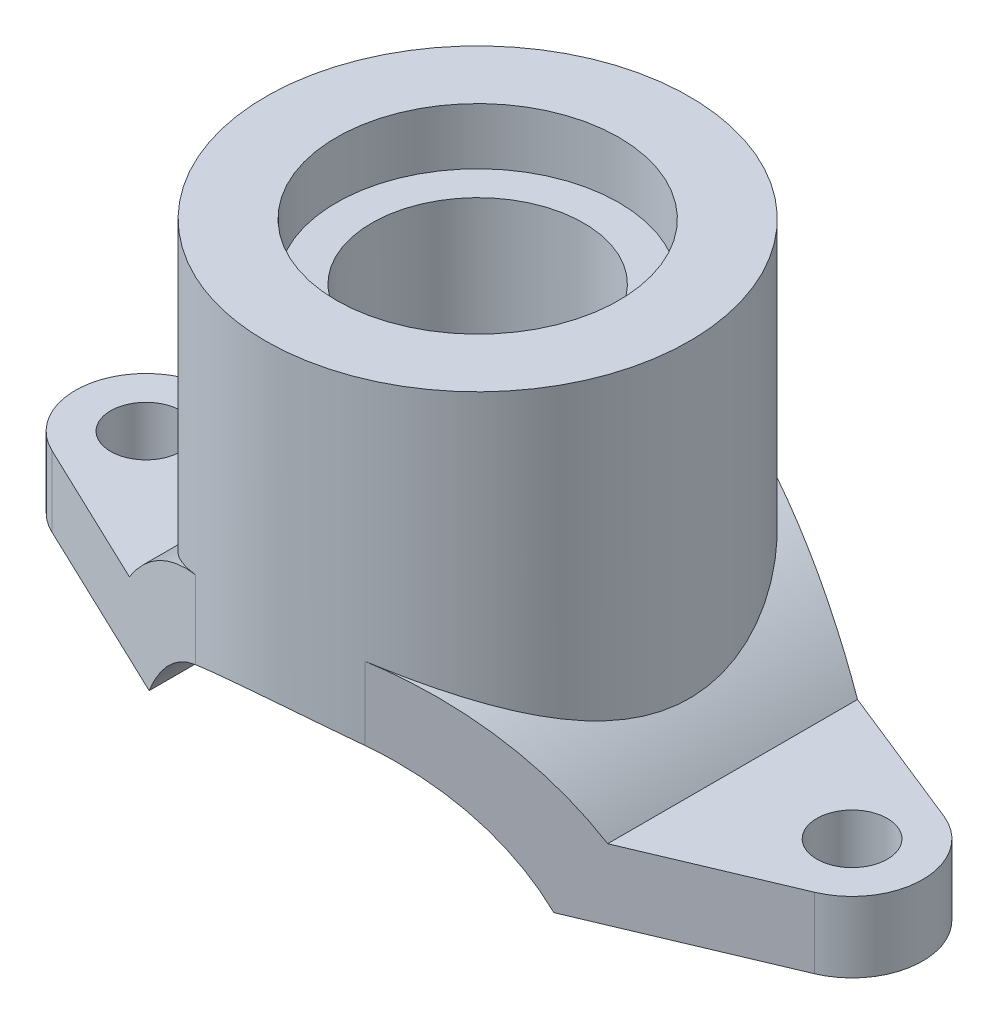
ISO-10303-21;
HEADER;
FILE_DESCRIPTION(('STEP AP214'),'2;1');
FILE_NAME('part.step','',(''),(''),'','','');
FILE_SCHEMA(('AUTOMOTIVE_DESIGN { 1 0 10303 214 1 1 1 1 }'));
ENDSEC;
DATA;
#1=APPLICATION_CONTEXT('core data for automotive mechanical design processes');
#2=APPLICATION_PROTOCOL_DEFINITION('international standard','automotive_design',2000,#1);
#3=PRODUCT_CONTEXT('',#1,'mechanical');
#4=PRODUCT('Part','Part','',(#3));
#5=PRODUCT_RELATED_PRODUCT_CATEGORY('part','',(#4));
#6=PRODUCT_DEFINITION_FORMATION('','',#4);
#7=PRODUCT_DEFINITION_CONTEXT('part definition',#1,'design');
#8=PRODUCT_DEFINITION('design','',#6,#7);
#9=PRODUCT_DEFINITION_SHAPE('','',#8);
#10=(LENGTH_UNIT() NAMED_UNIT(*) SI_UNIT(.MILLI.,.METRE.));
#11=(NAMED_UNIT(*) PLANE_ANGLE_UNIT() SI_UNIT($,.RADIAN.));
#12=(NAMED_UNIT(*) SI_UNIT($,.STERADIAN.) SOLID_ANGLE_UNIT());
#13=UNCERTAINTY_MEASURE_WITH_UNIT(LENGTH_MEASURE(1.E-05),#10,'distance_accuracy_value','');
#14=(GEOMETRIC_REPRESENTATION_CONTEXT(3) GLOBAL_UNCERTAINTY_ASSIGNED_CONTEXT((#13)) GLOBAL_UNIT_ASSIGNED_CONTEXT((#10,
#11,#12)) REPRESENTATION_CONTEXT('',''));
#15=CARTESIAN_POINT('',(0.,0.,0.));
#16=DIRECTION('',(0.,0.,1.));
#17=DIRECTION('',(1.,0.,0.));
#18=AXIS2_PLACEMENT_3D('',#15,#16,#17);
#19=CARTESIAN_POINT('',(0.,-39.,75.));
#20=DIRECTION('',(0.,0.,-1.));
#21=DIRECTION('',(-1.,0.,0.));
#22=AXIS2_PLACEMENT_3D('',#19,#20,#21);
#23=CYLINDRICAL_SURFACE('',#22,80.);
#24=CARTESIAN_POINT('',(0.,-39.,-85.1890786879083));
#25=DIRECTION('',(-0.412149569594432,0.,-0.911116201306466));
#26=DIRECTION('',(0.911116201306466,0.,-0.412149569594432));
#27=AXIS2_PLACEMENT_3D('',#24,#25,#26);
#28=ELLIPSE('',#27,87.8043875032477,80.);
#29=CARTESIAN_POINT('',(-37.2612177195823,31.7926666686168,-68.3337150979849));
#30=VERTEX_POINT('',#29);
#31=CARTESIAN_POINT('',(-69.8498389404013,0.,-53.5920321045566));
#32=VERTEX_POINT('',#31);
#33=EDGE_CURVE('E217',#30,#32,#28,.F.);
#34=ORIENTED_EDGE('',*,*,#33,.F.);
#35=CARTESIAN_POINT('',(21.5637087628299,38.0389931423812,-69.6119591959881));
#36=CARTESIAN_POINT('',(20.8455976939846,38.2400081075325,-69.8999258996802));
#37=CARTESIAN_POINT('',(20.1208285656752,38.4320373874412,-70.1776413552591));
#38=CARTESIAN_POINT('',(18.6587689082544,38.7972859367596,-70.7118580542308));
#39=CARTESIAN_POINT('',(17.9214773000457,38.9705035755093,-70.968357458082));
#40=CARTESIAN_POINT('',(16.4348906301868,39.2973433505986,-71.4595128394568));
#41=CARTESIAN_POINT('',(15.6855892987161,39.4509548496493,-71.6941569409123));
#42=CARTESIAN_POINT('',(14.1763858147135,39.7376657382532,-72.1407424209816));
#43=CARTESIAN_POINT('',(13.4164839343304,39.870765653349,-72.3526843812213));
#44=CARTESIAN_POINT('',(11.8872490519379,40.1156929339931,-72.7531951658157));
#45=CARTESIAN_POINT('',(11.1179172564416,40.2275229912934,-72.9417669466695));
#46=CARTESIAN_POINT('',(9.57085636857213,40.429259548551,-73.2949924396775));
#47=CARTESIAN_POINT('',(8.79312656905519,40.5191641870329,-73.4596441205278));
#48=CARTESIAN_POINT('',(7.23084337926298,40.6764148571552,-73.7644488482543));
#49=CARTESIAN_POINT('',(6.44629199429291,40.7437673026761,-73.9046088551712));
#50=CARTESIAN_POINT('',(4.87144401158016,40.8554458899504,-74.1600674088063));
#51=CARTESIAN_POINT('',(4.08114689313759,40.8997699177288,-74.2753636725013));
#52=CARTESIAN_POINT('',(2.49360850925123,40.965087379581,-74.4810943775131));
#53=CARTESIAN_POINT('',(1.69635274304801,40.9860005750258,-74.5714425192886));
#54=CARTESIAN_POINT('',(0.0990058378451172,41.0039262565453,-74.7265299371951));
#55=CARTESIAN_POINT('',(-0.701085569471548,41.0009364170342,-74.79126672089));
#56=CARTESIAN_POINT('',(-2.30246678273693,40.970869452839,-74.8950015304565));
#57=CARTESIAN_POINT('',(-3.1037565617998,40.9437928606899,-74.9340001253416));
#58=CARTESIAN_POINT('',(-4.70607465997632,40.8654888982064,-74.9862661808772));
#59=CARTESIAN_POINT('',(-5.50710294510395,40.8142591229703,-74.9995310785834));
#60=CARTESIAN_POINT('',(-7.10643973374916,40.6877739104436,-75.0004440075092));
#61=CARTESIAN_POINT('',(-7.90475019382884,40.6125433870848,-74.9881185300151));
#62=CARTESIAN_POINT('',(-9.49804098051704,40.4382122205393,-74.9381425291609));
#63=CARTESIAN_POINT('',(-10.2930209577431,40.3391091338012,-74.9004894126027));
#64=CARTESIAN_POINT('',(-11.8779812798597,40.1173412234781,-74.8002123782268));
#65=CARTESIAN_POINT('',(-12.6679624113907,39.9946802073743,-74.7375924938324));
#66=CARTESIAN_POINT('',(-14.2416620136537,39.7261875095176,-74.5878459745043));
#67=CARTESIAN_POINT('',(-15.0253798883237,39.5803536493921,-74.5007170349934));
#68=CARTESIAN_POINT('',(-17.3130153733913,39.1192872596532,-74.209974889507));
#69=CARTESIAN_POINT('',(-18.8067303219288,38.772943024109,-73.9735223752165));
#70=CARTESIAN_POINT('',(-21.7568430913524,37.9997823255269,-73.4158302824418));
#71=CARTESIAN_POINT('',(-23.213238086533,37.5729597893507,-73.0945843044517));
#72=CARTESIAN_POINT('',(-26.0816439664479,36.6440386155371,-72.3729880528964));
#73=CARTESIAN_POINT('',(-27.4936545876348,36.1419395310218,-71.9726373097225));
#74=CARTESIAN_POINT('',(-30.2672429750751,35.0682434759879,-71.0990772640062));
#75=CARTESIAN_POINT('',(-31.6288365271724,34.4966685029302,-70.6258910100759));
#76=CARTESIAN_POINT('',(-33.6970275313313,33.5614190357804,-69.8409384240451));
#77=CARTESIAN_POINT('',(-34.422672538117,33.2199214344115,-69.5523431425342));
#78=CARTESIAN_POINT('',(-35.8554593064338,32.5193709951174,-68.9567133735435));
#79=CARTESIAN_POINT('',(-36.5626387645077,32.1603590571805,-68.6497214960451));
#80=CARTESIAN_POINT('',(-37.2612177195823,31.7926666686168,-68.3337150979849));
#81=B_SPLINE_CURVE_WITH_KNOTS('',3,(#35,#36,#37,#38,#39,#40,#41,#42,#43,#44,#45,#46,#47,#48,#49,
#50,#51,#52,#53,#54,#55,#56,#57,#58,#59,#60,#61,#62,#63,#64,#65,#66,#67,#68,#69,#70,#71,#72,#73,
#74,#75,#76,#77,#78,#79,#80),.UNSPECIFIED.,.F.,.F.,(4,2,2,2,2,2,2,2,2,2,2,2,2,2,2,2,2,2,2,2,2,2,
4),(0.,2.39805193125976,4.79631156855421,7.19586689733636,9.59536073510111,11.9945507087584,
14.3939443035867,16.7926549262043,19.1915857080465,21.59871368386,24.0060758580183,
26.4133848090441,28.8209335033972,31.2259911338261,33.6312950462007,36.0362105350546,
38.4413522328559,43.0902682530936,47.7395352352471,52.3888298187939,57.0366561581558,
59.5931399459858,62.1439155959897),.UNSPECIFIED.);
#82=CARTESIAN_POINT('',(21.5637087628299,38.0389931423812,-69.6119591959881));
#83=VERTEX_POINT('',#82);
#84=EDGE_CURVE('E161',#83,#30,#81,.T.);
#85=ORIENTED_EDGE('',*,*,#84,.F.);
#86=CARTESIAN_POINT('',(0.,-39.,-78.2587936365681));
#87=DIRECTION('',(0.372182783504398,0.,-0.928159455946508));
#88=DIRECTION('',(-0.928159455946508,0.,-0.372182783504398));
#89=AXIS2_PLACEMENT_3D('',#86,#87,#88);
#90=ELLIPSE('',#89,86.1920863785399,80.);
#91=CARTESIAN_POINT('',(69.8498389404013,0.,-50.2496974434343));
#92=VERTEX_POINT('',#91);
#93=EDGE_CURVE('E298',#92,#83,#90,.F.);
#94=ORIENTED_EDGE('',*,*,#93,.F.);
#95=DIRECTION('',(0.,0.,-1.));
#96=VECTOR('',#95,1.);
#97=CARTESIAN_POINT('',(69.8498389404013,0.,75.));
#98=LINE('',#97,#96);
#99=CARTESIAN_POINT('',(69.8498389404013,0.,49.231503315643));
#100=VERTEX_POINT('',#99);
#101=EDGE_CURVE('E300',#100,#92,#98,.T.);
#102=ORIENTED_EDGE('',*,*,#101,.F.);
#103=CARTESIAN_POINT('',(0.,-39.,78.7331588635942));
#104=DIRECTION('',(0.389078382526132,0.,0.921204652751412));
#105=DIRECTION('',(0.921204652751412,0.,-0.389078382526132));
#106=AXIS2_PLACEMENT_3D('',#103,#104,#105);
#107=ELLIPSE('',#106,86.8428093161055,80.);
#108=CARTESIAN_POINT('',(22.8308786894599,37.6730133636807,69.0903489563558));
#109=VERTEX_POINT('',#108);
#110=EDGE_CURVE('E52',#109,#100,#107,.F.);
#111=ORIENTED_EDGE('',*,*,#110,.F.);
#112=CARTESIAN_POINT('',(-38.6433817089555,31.0477626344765,67.6914876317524));
#113=CARTESIAN_POINT('',(-37.9600259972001,31.4247501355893,68.0174928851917));
#114=CARTESIAN_POINT('',(-37.2680532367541,31.7934480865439,68.3349072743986));
#115=CARTESIAN_POINT('',(-35.8670916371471,32.5134406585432,68.9516298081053));
#116=CARTESIAN_POINT('',(-35.1581010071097,32.8647334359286,69.2509360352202));
#117=CARTESIAN_POINT('',(-33.0052076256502,33.8915993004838,70.1205848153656));
#118=CARTESIAN_POINT('',(-31.5362809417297,34.5396628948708,70.6622270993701));
#119=CARTESIAN_POINT('',(-28.5302656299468,35.757370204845,71.6627893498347));
#120=CARTESIAN_POINT('',(-26.9929014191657,36.3266500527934,72.1213283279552));
#121=CARTESIAN_POINT('',(-24.646282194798,37.1133506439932,72.7385792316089));
#122=CARTESIAN_POINT('',(-23.8573120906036,37.364381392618,72.9325702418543));
#123=CARTESIAN_POINT('',(-22.2668181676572,37.8432052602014,73.2961120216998));
#124=CARTESIAN_POINT('',(-21.4652955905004,38.0710006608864,73.4656651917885));
#125=CARTESIAN_POINT('',(-19.8464338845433,38.5037095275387,73.7802819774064));
#126=CARTESIAN_POINT('',(-19.0290318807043,38.7084897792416,73.9252052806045));
#127=CARTESIAN_POINT('',(-17.3841934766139,39.0929127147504,74.1885447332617));
#128=CARTESIAN_POINT('',(-16.5567581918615,39.2725581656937,74.3069638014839));
#129=CARTESIAN_POINT('',(-14.8930985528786,39.6060780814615,74.5165654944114));
#130=CARTESIAN_POINT('',(-14.0568724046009,39.759947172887,74.6077424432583));
#131=CARTESIAN_POINT('',(-12.3775168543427,40.0412665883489,74.7621559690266));
#132=CARTESIAN_POINT('',(-11.5343882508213,40.1687199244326,74.8253957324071));
#133=CARTESIAN_POINT('',(-9.84483476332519,40.396499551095,74.9232973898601));
#134=CARTESIAN_POINT('',(-8.99842221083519,40.4968886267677,74.9580258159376));
#135=CARTESIAN_POINT('',(-7.30222530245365,40.6705982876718,74.998752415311));
#136=CARTESIAN_POINT('',(-6.45244132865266,40.743921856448,75.0047537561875));
#137=CARTESIAN_POINT('',(-4.75129130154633,40.8633347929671,74.9877833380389));
#138=CARTESIAN_POINT('',(-3.89992532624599,40.9094254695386,74.9648129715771));
#139=CARTESIAN_POINT('',(-2.19744464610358,40.974351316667,74.8898008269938));
#140=CARTESIAN_POINT('',(-1.34632993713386,40.9931869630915,74.8377595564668));
#141=CARTESIAN_POINT('',(0.288276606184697,41.0033280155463,74.709789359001));
#142=CARTESIAN_POINT('',(1.07192586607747,40.9966428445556,74.6360099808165));
#143=CARTESIAN_POINT('',(2.63605717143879,40.9603853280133,74.4638830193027));
#144=CARTESIAN_POINT('',(3.41653893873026,40.9308110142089,74.3655333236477));
#145=CARTESIAN_POINT('',(4.97284179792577,40.8490947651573,74.1445270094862));
#146=CARTESIAN_POINT('',(5.74866306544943,40.7969536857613,74.0218713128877));
#147=CARTESIAN_POINT('',(7.29434566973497,40.6705349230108,73.7526105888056));
#148=CARTESIAN_POINT('',(8.06420646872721,40.5962552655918,73.6060034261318));
#149=CARTESIAN_POINT('',(10.3629351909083,40.3409430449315,73.1308750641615));
#150=CARTESIAN_POINT('',(11.8811328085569,40.1274274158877,72.7670208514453));
#151=CARTESIAN_POINT('',(14.8785608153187,39.6189474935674,71.9497113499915));
#152=CARTESIAN_POINT('',(16.3578057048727,39.3240139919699,71.4962899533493));
#153=CARTESIAN_POINT('',(18.2406584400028,38.8939698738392,70.8555098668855));
#154=CARTESIAN_POINT('',(18.6656705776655,38.7932036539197,70.7065659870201));
#155=CARTESIAN_POINT('',(19.5115140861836,38.58537457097,70.4015913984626));
#156=CARTESIAN_POINT('',(19.9323462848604,38.4783129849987,70.2455621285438));
#157=CARTESIAN_POINT('',(20.7686539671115,38.2583296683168,69.9269500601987));
#158=CARTESIAN_POINT('',(21.1841404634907,38.1454237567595,69.7643851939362));
#159=CARTESIAN_POINT('',(22.0107994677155,37.9136466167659,69.4324383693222));
#160=CARTESIAN_POINT('',(22.4219711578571,37.7947742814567,69.2630551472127));
#161=CARTESIAN_POINT('',(22.8308786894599,37.6730133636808,69.0903489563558));
#162=B_SPLINE_CURVE_WITH_KNOTS('',3,(#112,#113,#114,#115,#116,#117,#118,#119,#120,#121,#122,
#123,#124,#125,#126,#127,#128,#129,#130,#131,#132,#133,#134,#135,#136,#137,#138,#139,#140,#141,
#142,#143,#144,#145,#146,#147,#148,#149,#150,#151,#152,#153,#154,#155,#156,#157,#158,#159,#160,
#161),.UNSPECIFIED.,.F.,.F.,(4,2,2,2,2,2,2,2,2,2,2,2,2,2,2,2,2,2,2,2,2,2,2,2,4),(0.,
2.53715911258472,5.07458640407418,10.1527706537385,15.2536774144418,17.8041405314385,
20.3543529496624,22.9186390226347,25.4826425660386,28.0471799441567,30.6114247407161,
33.1696686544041,35.7276304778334,38.2854693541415,40.8432635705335,43.2039756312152,
45.5648907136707,47.9257162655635,50.2867523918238,55.0082699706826,59.7280043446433,
61.1124108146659,62.4965374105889,63.8770956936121,65.2579110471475),.UNSPECIFIED.);
#163=CARTESIAN_POINT('',(-38.6433817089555,31.0477626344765,67.6914876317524));
#164=VERTEX_POINT('',#163);
#165=EDGE_CURVE('E151',#164,#109,#162,.T.);
#166=ORIENTED_EDGE('',*,*,#165,.F.);
#167=CARTESIAN_POINT('',(0.,-39.,86.1269736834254));
#168=DIRECTION('',(-0.430578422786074,0.,0.902553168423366));
#169=DIRECTION('',(-0.902553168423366,0.,-0.430578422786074));
#170=AXIS2_PLACEMENT_3D('',#167,#168,#169);
#171=ELLIPSE('',#170,88.637437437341,80.);
#172=CARTESIAN_POINT('',(-69.8498389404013,0.,52.8039135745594));
#173=VERTEX_POINT('',#172);
#174=EDGE_CURVE('E324',#173,#164,#171,.F.);
#175=ORIENTED_EDGE('',*,*,#174,.F.);
#176=DIRECTION('',(0.,0.,-1.));
#177=VECTOR('',#176,1.);
#178=CARTESIAN_POINT('',(-69.8498389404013,0.,75.));
#179=LINE('',#178,#177);
#180=EDGE_CURVE('E308',#173,#32,#179,.T.);
#181=ORIENTED_EDGE('',*,*,#180,.T.);
#182=EDGE_LOOP('',(#34,#85,#94,#102,#111,#166,#175,#181));
#183=FACE_BOUND('',#182,.T.);
#184=CARTESIAN_POINT('',(-6.35,40.7475861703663,37.5));
#185=CARTESIAN_POINT('',(-7.36468223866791,40.6667837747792,37.4999919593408));
#186=CARTESIAN_POINT('',(-8.37806557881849,40.5665580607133,37.4587610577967));
#187=CARTESIAN_POINT('',(-10.39420654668,40.3283814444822,37.2950181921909));
#188=CARTESIAN_POINT('',(-11.3969575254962,40.190408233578,37.172458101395));
#189=CARTESIAN_POINT('',(-13.3862135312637,39.8785464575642,36.8477890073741));
#190=CARTESIAN_POINT('',(-14.372676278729,39.7045766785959,36.6454991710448));
#191=CARTESIAN_POINT('',(-16.3200464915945,39.3239454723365,36.1642661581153));
#192=CARTESIAN_POINT('',(-17.2809574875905,39.1172885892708,35.8853336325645));
#193=CARTESIAN_POINT('',(-19.1669901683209,38.6759947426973,35.2556180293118));
#194=CARTESIAN_POINT('',(-20.0922588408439,38.441493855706,34.9051788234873));
#195=CARTESIAN_POINT('',(-21.9067307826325,37.9478997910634,34.1351659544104));
#196=CARTESIAN_POINT('',(-22.7959330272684,37.6888059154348,33.7155903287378));
#197=CARTESIAN_POINT('',(-24.53362900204,37.1506934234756,32.8110466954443));
#198=CARTESIAN_POINT('',(-25.3821376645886,36.871682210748,32.3261029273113));
#199=CARTESIAN_POINT('',(-27.0351397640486,36.2985166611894,31.2941601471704));
#200=CARTESIAN_POINT('',(-27.8396314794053,36.0043617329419,30.7471587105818));
#201=CARTESIAN_POINT('',(-29.4580582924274,35.3843206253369,29.5525181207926));
#202=CARTESIAN_POINT('',(-30.2684429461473,35.0576807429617,28.900456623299));
#203=CARTESIAN_POINT('',(-31.8312409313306,34.3995308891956,27.5324347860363));
#204=CARTESIAN_POINT('',(-32.5836516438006,34.0680206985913,26.8164715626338));
#205=CARTESIAN_POINT('',(-34.0276690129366,33.4068292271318,25.3234316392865));
#206=CARTESIAN_POINT('',(-34.7192189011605,33.0771499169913,24.546299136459));
#207=CARTESIAN_POINT('',(-36.0371584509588,32.4273275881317,22.934823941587));
#208=CARTESIAN_POINT('',(-36.6635458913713,32.1071848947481,22.1004793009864));
#209=CARTESIAN_POINT('',(-37.884217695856,31.4648204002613,20.3242583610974));
#210=CARTESIAN_POINT('',(-38.4740686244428,31.143712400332,19.3789211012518));
#211=CARTESIAN_POINT('',(-39.5708164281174,30.5308948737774,17.4320283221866));
#212=CARTESIAN_POINT('',(-40.0777075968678,30.2391873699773,16.4304689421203));
#213=CARTESIAN_POINT('',(-41.0024280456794,29.6956218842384,14.3779236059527));
#214=CARTESIAN_POINT('',(-41.4203542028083,29.4437206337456,13.3269929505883));
#215=CARTESIAN_POINT('',(-42.1619913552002,28.9893820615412,11.1820480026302));
#216=CARTESIAN_POINT('',(-42.4857197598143,28.7869356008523,10.088041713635));
#217=CARTESIAN_POINT('',(-43.0060468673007,28.4578753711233,7.9777224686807));
#218=CARTESIAN_POINT('',(-43.2121373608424,28.3256936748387,6.96461679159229));
#219=CARTESIAN_POINT('',(-43.5403405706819,28.1139119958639,4.91942764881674));
#220=CARTESIAN_POINT('',(-43.6624596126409,28.034308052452,3.88734561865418));
#221=CARTESIAN_POINT('',(-43.8204717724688,27.931122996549,1.81468684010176));
#222=CARTESIAN_POINT('',(-43.8564387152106,27.907493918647,0.774118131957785));
#223=CARTESIAN_POINT('',(-43.8416746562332,27.9171708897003,-1.306086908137));
#224=CARTESIAN_POINT('',(-43.7909520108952,27.9504714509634,-2.34572332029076));
#225=CARTESIAN_POINT('',(-43.6167774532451,28.0640398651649,-4.27059324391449));
#226=CARTESIAN_POINT('',(-43.5043645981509,28.1371684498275,-5.15727963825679));
#227=CARTESIAN_POINT('',(-43.217443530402,28.322223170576,-6.91632468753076));
#228=CARTESIAN_POINT('',(-43.0429424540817,28.4341448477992,-7.78868497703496));
#229=CARTESIAN_POINT('',(-42.6338808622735,28.6935057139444,-9.51401015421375));
#230=CARTESIAN_POINT('',(-42.399303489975,28.8409548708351,-10.3669695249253));
#231=CARTESIAN_POINT('',(-41.87258782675,29.167310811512,-12.0487475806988));
#232=CARTESIAN_POINT('',(-41.5804456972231,29.3462196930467,-12.8775646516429));
#233=CARTESIAN_POINT('',(-40.9276479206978,29.7392089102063,-14.5419807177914));
#234=CARTESIAN_POINT('',(-40.5646021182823,29.9544636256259,-15.3763621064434));
#235=CARTESIAN_POINT('',(-39.7817802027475,30.409038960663,-17.0113972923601));
#236=CARTESIAN_POINT('',(-39.3619981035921,30.64836211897,-17.8120475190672));
#237=CARTESIAN_POINT('',(-38.691982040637,31.0213962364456,-18.9855026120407));
#238=CARTESIAN_POINT('',(-38.4618476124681,31.1481209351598,-19.3721747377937));
#239=CARTESIAN_POINT('',(-37.9885151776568,31.4055770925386,-20.1359414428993));
#240=CARTESIAN_POINT('',(-37.7453202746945,31.5363075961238,-20.5130382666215));
#241=CARTESIAN_POINT('',(-36.9964887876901,31.9336246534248,-21.6297520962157));
#242=CARTESIAN_POINT('',(-36.4716186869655,32.2053293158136,-22.3547692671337));
#243=CARTESIAN_POINT('',(-35.2882754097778,32.8000083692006,-23.8723658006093));
#244=CARTESIAN_POINT('',(-34.6216926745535,33.1244144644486,-24.6580589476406));
#245=CARTESIAN_POINT('',(-33.2271252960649,33.7774071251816,-26.1711440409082));
#246=CARTESIAN_POINT('',(-32.4991353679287,34.1059940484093,-26.8985309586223));
#247=CARTESIAN_POINT('',(-30.9847257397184,34.7606099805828,-28.2920429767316));
#248=CARTESIAN_POINT('',(-30.1982711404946,35.0866373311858,-28.9581309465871));
#249=CARTESIAN_POINT('',(-28.570785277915,35.7293497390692,-30.224991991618));
#250=CARTESIAN_POINT('',(-27.7297529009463,36.0460346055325,-30.8257637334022));
#251=CARTESIAN_POINT('',(-25.9349948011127,36.6858436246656,-31.9985537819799));
#252=CARTESIAN_POINT('',(-24.9775097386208,37.0078161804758,-32.5654654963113));
#253=CARTESIAN_POINT('',(-23.0094189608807,37.6265661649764,-33.6148386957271));
#254=CARTESIAN_POINT('',(-21.9988098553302,37.9233419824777,-34.0972947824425));
#255=CARTESIAN_POINT('',(-19.931370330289,38.4847536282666,-34.9722105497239));
#256=CARTESIAN_POINT('',(-18.8745653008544,38.7494068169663,-35.3647189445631));
#257=CARTESIAN_POINT('',(-16.7218415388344,39.2406435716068,-36.0548480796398));
#258=CARTESIAN_POINT('',(-15.6259272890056,39.4672314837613,-36.3524796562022));
#259=CARTESIAN_POINT('',(-13.4876339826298,39.8617478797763,-36.8295013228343));
#260=CARTESIAN_POINT('',(-12.4474412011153,40.032809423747,-37.016109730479));
#261=CARTESIAN_POINT('',(-10.3492665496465,40.334832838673,-37.3011594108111));
#262=CARTESIAN_POINT('',(-9.29128547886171,40.4657965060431,-37.3996046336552));
#263=CARTESIAN_POINT('',(-7.16696498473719,40.685471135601,-37.5061732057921));
#264=CARTESIAN_POINT('',(-6.10063024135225,40.7742042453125,-37.5143439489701));
#265=CARTESIAN_POINT('',(-3.96847244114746,40.9086475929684,-37.4394977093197));
#266=CARTESIAN_POINT('',(-2.90264935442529,40.9543607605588,-37.3564869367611));
#267=CARTESIAN_POINT('',(-0.878939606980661,41.000973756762,-37.1114362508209));
#268=CARTESIAN_POINT('',(0.0798403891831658,41.0056159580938,-36.9573863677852));
#269=CARTESIAN_POINT('',(1.98208524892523,40.9810974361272,-36.5755011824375));
#270=CARTESIAN_POINT('',(2.92555123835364,40.9519392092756,-36.3476713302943));
#271=CARTESIAN_POINT('',(4.79055491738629,40.8618953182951,-35.8200680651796));
#272=CARTESIAN_POINT('',(5.71209267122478,40.801009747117,-35.5202948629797));
#273=CARTESIAN_POINT('',(7.52714319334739,40.6503076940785,-34.8512621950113));
#274=CARTESIAN_POINT('',(8.42065510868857,40.560490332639,-34.4820006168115));
#275=CARTESIAN_POINT('',(10.1773646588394,40.3549389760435,-33.6754199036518));
#276=CARTESIAN_POINT('',(11.0404366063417,40.2391094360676,-33.2378517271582));
#277=CARTESIAN_POINT('',(12.7277550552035,39.9856454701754,-32.2989394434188));
#278=CARTESIAN_POINT('',(13.5520018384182,39.8480112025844,-31.7975957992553));
#279=CARTESIAN_POINT('',(15.1575145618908,39.5551770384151,-30.7344116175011));
#280=CARTESIAN_POINT('',(15.9387689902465,39.3999724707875,-30.1725549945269));
#281=CARTESIAN_POINT('',(17.4541661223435,39.0765813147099,-28.9919726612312));
#282=CARTESIAN_POINT('',(18.188306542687,38.9083940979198,-28.3732441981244));
#283=CARTESIAN_POINT('',(19.6584440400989,38.5510100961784,-27.0346160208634));
#284=CARTESIAN_POINT('',(20.3905723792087,38.3611790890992,-26.3106190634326));
#285=CARTESIAN_POINT('',(21.4417882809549,38.0738726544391,-25.181958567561));
#286=CARTESIAN_POINT('',(21.7843846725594,37.9776709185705,-24.798601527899));
#287=CARTESIAN_POINT('',(22.4536041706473,37.7851345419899,-24.018049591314));
#288=CARTESIAN_POINT('',(22.7802233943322,37.6887998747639,-23.6208513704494));
#289=CARTESIAN_POINT('',(23.7354065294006,37.4007384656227,-22.4092857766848));
#290=CARTESIAN_POINT('',(24.3392526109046,37.2099663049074,-21.5749939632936));
#291=CARTESIAN_POINT('',(25.4770767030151,36.8371755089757,-19.8581880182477));
#292=CARTESIAN_POINT('',(26.0110556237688,36.6551567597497,-18.9756745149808));
#293=CARTESIAN_POINT('',(26.7670504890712,36.3896558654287,-17.6011223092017));
#294=CARTESIAN_POINT('',(27.0158977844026,36.3007685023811,-17.1247184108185));
#295=CARTESIAN_POINT('',(27.4931505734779,36.1278313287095,-16.1610716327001));
#296=CARTESIAN_POINT('',(27.7215608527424,36.0437803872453,-15.6738313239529));
#297=CARTESIAN_POINT('',(28.3755281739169,35.8000421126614,-14.1967208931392));
#298=CARTESIAN_POINT('',(28.7698656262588,35.6487536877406,-13.1913814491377));
#299=CARTESIAN_POINT('',(29.471062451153,35.3747152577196,-11.147573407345));
#300=CARTESIAN_POINT('',(29.7779678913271,35.2519502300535,-10.109122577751));
#301=CARTESIAN_POINT('',(30.3013663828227,35.0399025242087,-8.00629910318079));
#302=CARTESIAN_POINT('',(30.5178663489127,34.9506172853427,-6.94192844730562));
#303=CARTESIAN_POINT('',(30.8484363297,34.8133059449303,-4.85580222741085));
#304=CARTESIAN_POINT('',(30.967539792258,34.7632588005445,-3.83497499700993));
#305=CARTESIAN_POINT('',(31.1215373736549,34.6984192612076,-1.78587339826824));
#306=CARTESIAN_POINT('',(31.1564345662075,34.6836255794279,-0.757599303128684));
#307=CARTESIAN_POINT('',(31.1416184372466,34.6898882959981,1.29801183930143));
#308=CARTESIAN_POINT('',(31.0919221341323,34.7109374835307,2.32534903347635));
#309=CARTESIAN_POINT('',(30.908525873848,34.7880267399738,4.37114761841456));
#310=CARTESIAN_POINT('',(30.7748275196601,34.8440661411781,5.3896091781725));
#311=CARTESIAN_POINT('',(30.4339667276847,34.9851719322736,7.35766162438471));
#312=CARTESIAN_POINT('',(30.2309522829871,35.0685908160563,8.30809399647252));
#313=CARTESIAN_POINT('',(29.7526330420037,35.2620179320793,10.1877548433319));
#314=CARTESIAN_POINT('',(29.4773312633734,35.3720250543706,11.1169842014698));
#315=CARTESIAN_POINT('',(28.8567133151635,35.6150188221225,12.9488528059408));
#316=CARTESIAN_POINT('',(28.5113825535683,35.7480102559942,13.8514864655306));
#317=CARTESIAN_POINT('',(27.753396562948,36.0327449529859,15.6249319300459));
#318=CARTESIAN_POINT('',(27.3407381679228,36.1844890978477,16.4957422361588));
#319=CARTESIAN_POINT('',(26.4295553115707,36.5097577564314,18.2418767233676));
#320=CARTESIAN_POINT('',(25.9278704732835,36.6839764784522,19.1154289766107));
#321=CARTESIAN_POINT('',(25.1248586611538,36.9527558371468,20.3920623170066));
#322=CARTESIAN_POINT('',(24.8487572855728,37.0435960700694,20.8120132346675));
#323=CARTESIAN_POINT('',(24.2800362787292,37.2270893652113,21.6403163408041));
#324=CARTESIAN_POINT('',(23.9874130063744,37.3197428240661,22.0486659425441));
#325=CARTESIAN_POINT('',(23.0853927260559,37.5993533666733,23.2554592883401));
#326=CARTESIAN_POINT('',(22.4518417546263,37.7879618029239,24.0356531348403));
#327=CARTESIAN_POINT('',(21.1239874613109,38.1638069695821,25.5428809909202));
#328=CARTESIAN_POINT('',(20.4296830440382,38.3510436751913,26.2699140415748));
#329=CARTESIAN_POINT('',(19.3227171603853,38.6324021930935,27.3394797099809));
#330=CARTESIAN_POINT('',(18.930436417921,38.7290656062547,27.7026241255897));
#331=CARTESIAN_POINT('',(18.1304245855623,38.9195533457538,28.4120505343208));
#332=CARTESIAN_POINT('',(17.7226970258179,39.0133783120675,28.758336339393));
#333=CARTESIAN_POINT('',(16.4769699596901,39.2894146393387,29.7712047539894));
#334=CARTESIAN_POINT('',(15.6163832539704,39.466198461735,30.4118397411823));
#335=CARTESIAN_POINT('',(13.8404694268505,39.7988447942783,31.6187960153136));
#336=CARTESIAN_POINT('',(12.9251248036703,39.9547005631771,32.1850933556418));
#337=CARTESIAN_POINT('',(11.0458968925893,40.2394526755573,33.2384205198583));
#338=CARTESIAN_POINT('',(10.0820178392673,40.3683513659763,33.7254572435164));
#339=CARTESIAN_POINT('',(8.14060568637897,40.5905640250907,34.6031040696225));
#340=CARTESIAN_POINT('',(7.16423667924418,40.684784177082,34.9960587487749));
#341=CARTESIAN_POINT('',(5.17926051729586,40.838374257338,35.6992257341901));
#342=CARTESIAN_POINT('',(4.17064913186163,40.8977395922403,36.0094271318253));
#343=CARTESIAN_POINT('',(2.13198100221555,40.9780774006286,36.5433126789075));
#344=CARTESIAN_POINT('',(1.10198388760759,40.9991450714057,36.7672102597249));
#345=CARTESIAN_POINT('',(-0.972759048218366,41.0008027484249,37.1273835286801));
#346=CARTESIAN_POINT('',(-2.0174950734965,40.9814184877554,37.2637148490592));
#347=CARTESIAN_POINT('',(-3.61177087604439,40.9203051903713,37.4039268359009));
#348=CARTESIAN_POINT('',(-4.15927892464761,40.89368839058,37.4399695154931));
#349=CARTESIAN_POINT('',(-5.25465071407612,40.8291275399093,37.4880075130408));
#350=CARTESIAN_POINT('',(-5.80251443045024,40.7911841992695,37.5000043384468));
#351=CARTESIAN_POINT('',(-6.35,40.7475861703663,37.5));
#352=B_SPLINE_CURVE_WITH_KNOTS('',3,(#184,#185,#186,#187,#188,#189,#190,#191,#192,#193,#194,
#195,#196,#197,#198,#199,#200,#201,#202,#203,#204,#205,#206,#207,#208,#209,#210,#211,#212,#213,
#214,#215,#216,#217,#218,#219,#220,#221,#222,#223,#224,#225,#226,#227,#228,#229,#230,#231,#232,
#233,#234,#235,#236,#237,#238,#239,#240,#241,#242,#243,#244,#245,#246,#247,#248,#249,#250,#251,
#252,#253,#254,#255,#256,#257,#258,#259,#260,#261,#262,#263,#264,#265,#266,#267,#268,#269,#270,
#271,#272,#273,#274,#275,#276,#277,#278,#279,#280,#281,#282,#283,#284,#285,#286,#287,#288,#289,
#290,#291,#292,#293,#294,#295,#296,#297,#298,#299,#300,#301,#302,#303,#304,#305,#306,#307,#308,
#309,#310,#311,#312,#313,#314,#315,#316,#317,#318,#319,#320,#321,#322,#323,#324,#325,#326,#327,
#328,#329,#330,#331,#332,#333,#334,#335,#336,#337,#338,#339,#340,#341,#342,#343,#344,#345,#346,
#347,#348,#349,#350,#351),.UNSPECIFIED.,.T.,.F.,(4,2,2,2,2,2,2,2,2,2,2,2,2,2,2,2,2,2,2,2,2,2,2,
2,2,2,2,2,2,2,2,2,2,2,2,2,2,2,2,2,2,2,2,2,2,2,2,2,2,2,2,2,2,2,2,2,2,2,2,2,2,2,2,2,2,2,2,2,2,2,2,
2,2,2,2,2,2,2,2,2,2,2,2,4),(0.,3.05311463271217,6.10803756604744,9.1699295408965,
12.2313962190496,15.2784734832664,18.3256372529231,21.3716741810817,24.4178301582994,
27.6850164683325,30.9523502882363,34.222700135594,37.493161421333,40.9674384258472,
44.4419543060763,47.9126670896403,51.3827380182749,54.5049048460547,57.6268364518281,
60.7460918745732,63.8650466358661,66.5522749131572,69.2391944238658,71.9268686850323,
74.6147222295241,77.4171798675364,80.219933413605,81.6221161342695,83.0239671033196,
85.8277520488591,89.0650483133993,92.3026234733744,95.5421469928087,98.7817366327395,
102.252375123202,105.723235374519,109.192211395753,112.660791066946,115.868076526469,
119.075218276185,122.280676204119,125.485915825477,128.395704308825,131.305277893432,
134.214842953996,137.124496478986,140.045017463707,142.96551724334,145.886795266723,
148.808214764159,151.945435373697,153.514247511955,155.083439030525,158.222015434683,
161.360550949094,162.994435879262,164.627937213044,167.894663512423,171.159665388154,
174.424417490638,177.507331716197,180.590133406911,183.672314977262,186.754437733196,
189.677478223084,192.600396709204,195.523924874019,198.447590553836,201.510934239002,
203.042775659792,204.574955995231,207.639296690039,210.703692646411,212.332950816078,
213.961838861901,217.219433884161,220.478075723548,223.736433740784,226.902307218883,
230.068597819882,233.227007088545,236.383407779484,238.030860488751,239.678209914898),.UNSPECIFIED.);
#353=CARTESIAN_POINT('',(-6.35,40.7475861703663,37.5));
#354=VERTEX_POINT('',#353);
#355=EDGE_CURVE('E37',#354,#354,#352,.T.);
#356=ORIENTED_EDGE('',*,*,#355,.F.);
#357=EDGE_LOOP('',(#356));
#358=FACE_BOUND('',#357,.T.);
#359=ADVANCED_FACE('F33',(#183,#358),#23,.F.);
#360=CARTESIAN_POINT('',(-6.34999999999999,150.,0.));
#361=DIRECTION('',(0.,1.,0.));
#362=DIRECTION('',(0.,0.,1.));
#363=AXIS2_PLACEMENT_3D('',#360,#361,#362);
#364=PLANE('',#363);
#365=CARTESIAN_POINT('',(-6.34999999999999,150.,0.));
#366=DIRECTION('',(0.,1.,0.));
#367=DIRECTION('',(0.,0.,1.));
#368=AXIS2_PLACEMENT_3D('',#365,#366,#367);
#369=CIRCLE('',#368,75.);
#370=CARTESIAN_POINT('',(-6.34999999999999,150.,75.));
#371=VERTEX_POINT('',#370);
#372=EDGE_CURVE('E221',#371,#371,#369,.T.);
#373=ORIENTED_EDGE('',*,*,#372,.T.);
#374=EDGE_LOOP('',(#373));
#375=FACE_BOUND('',#374,.T.);
#376=CARTESIAN_POINT('',(-6.35,150.,0.));
#377=DIRECTION('',(0.,1.,0.));
#378=DIRECTION('',(0.,0.,1.));
#379=AXIS2_PLACEMENT_3D('',#376,#377,#378);
#380=CIRCLE('',#379,50.);
#381=CARTESIAN_POINT('',(-6.35,150.,50.));
#382=VERTEX_POINT('',#381);
#383=EDGE_CURVE('E222',#382,#382,#380,.T.);
#384=ORIENTED_EDGE('',*,*,#383,.F.);
#385=EDGE_LOOP('',(#384));
#386=FACE_BOUND('',#385,.T.);
#387=ADVANCED_FACE('F206',(#375,#386),#364,.T.);
#388=CARTESIAN_POINT('',(0.,-39.,75.));
#389=DIRECTION('',(0.,0.,-1.));
#390=DIRECTION('',(-1.,0.,0.));
#391=AXIS2_PLACEMENT_3D('',#388,#389,#390);
#392=CYLINDRICAL_SURFACE('',#391,105.);
#393=CARTESIAN_POINT('',(0.,-39.,86.1269736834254));
#394=DIRECTION('',(-0.430578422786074,0.,0.902553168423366));
#395=DIRECTION('',(-0.902553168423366,0.,-0.430578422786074));
#396=AXIS2_PLACEMENT_3D('',#393,#394,#395);
#397=ELLIPSE('',#396,116.33663663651,105.);
#398=CARTESIAN_POINT('',(-38.6433817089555,58.6303695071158,67.6914876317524));
#399=VERTEX_POINT('',#398);
#400=CARTESIAN_POINT('',(-83.240615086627,25.,46.4156148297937));
#401=VERTEX_POINT('',#400);
#402=EDGE_CURVE('E294',#399,#401,#397,.T.);
#403=ORIENTED_EDGE('',*,*,#402,.F.);
#404=CARTESIAN_POINT('',(-6.34999999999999,65.8078122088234,75.));
#405=CARTESIAN_POINT('',(-5.43964576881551,65.8629672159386,74.9999992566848));
#406=CARTESIAN_POINT('',(-4.52854695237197,65.9062577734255,74.9834187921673));
#407=CARTESIAN_POINT('',(-2.70664258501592,65.9690671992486,74.9170009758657));
#408=CARTESIAN_POINT('',(-1.79583708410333,65.9885831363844,74.8671595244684));
#409=CARTESIAN_POINT('',(0.0238617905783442,66.0039407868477,74.7342384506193));
#410=CARTESIAN_POINT('',(0.932754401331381,65.9997743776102,74.6511474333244));
#411=CARTESIAN_POINT('',(2.74658956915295,65.9679908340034,74.4518944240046));
#412=CARTESIAN_POINT('',(3.65153169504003,65.9403712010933,74.335728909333));
#413=CARTESIAN_POINT('',(5.45698597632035,65.8619998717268,74.0704318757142));
#414=CARTESIAN_POINT('',(6.35748916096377,65.8112126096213,73.9212498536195));
#415=CARTESIAN_POINT('',(8.15103384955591,65.6870039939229,73.5904319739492));
#416=CARTESIAN_POINT('',(9.04407455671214,65.6135802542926,73.4087926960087));
#417=CARTESIAN_POINT('',(10.8207687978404,65.4447560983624,73.0136474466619));
#418=CARTESIAN_POINT('',(11.7044243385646,65.3493604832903,72.8001484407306));
#419=CARTESIAN_POINT('',(13.4610922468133,65.1373220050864,72.3418601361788));
#420=CARTESIAN_POINT('',(14.3341035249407,65.0206769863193,72.09706766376));
#421=CARTESIAN_POINT('',(16.06368291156,64.7676157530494,71.5781940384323));
#422=CARTESIAN_POINT('',(16.9203110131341,64.631300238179,71.3042638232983));
#423=CARTESIAN_POINT('',(18.620259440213,64.3393929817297,70.7268854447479));
#424=CARTESIAN_POINT('',(19.4635784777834,64.1837993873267,70.4234344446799));
#425=CARTESIAN_POINT('',(21.9715988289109,63.6895829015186,69.4700264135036));
#426=CARTESIAN_POINT('',(23.6147745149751,63.3234634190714,68.7768906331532));
#427=CARTESIAN_POINT('',(26.8341625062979,62.5267383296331,67.2826983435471));
#428=CARTESIAN_POINT('',(28.4103902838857,62.0961477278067,66.4816669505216));
#429=CARTESIAN_POINT('',(31.4902258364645,61.1795740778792,64.7781918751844));
#430=CARTESIAN_POINT('',(32.9938309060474,60.6935889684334,63.8757444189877));
#431=CARTESIAN_POINT('',(36.0299019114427,59.6388012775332,61.9067966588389));
#432=CARTESIAN_POINT('',(37.5565225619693,59.0665466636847,60.8331400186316));
#433=CARTESIAN_POINT('',(40.5157762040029,57.8814365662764,58.5837339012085));
#434=CARTESIAN_POINT('',(41.9484055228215,57.2685794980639,57.4079804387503));
#435=CARTESIAN_POINT('',(44.7175308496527,56.0139745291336,54.9593221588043));
#436=CARTESIAN_POINT('',(46.053921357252,55.3721961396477,53.6863137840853));
#437=CARTESIAN_POINT('',(48.6258006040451,54.0731298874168,51.0495220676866));
#438=CARTESIAN_POINT('',(49.8612831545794,53.4158410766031,49.6857331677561));
#439=CARTESIAN_POINT('',(52.428918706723,51.987449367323,46.6332709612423));
#440=CARTESIAN_POINT('',(53.7419996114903,51.2159262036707,44.9286955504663));
#441=CARTESIAN_POINT('',(56.2208724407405,49.6923373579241,41.4068117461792));
#442=CARTESIAN_POINT('',(57.386634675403,48.9402756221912,39.5894807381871));
#443=CARTESIAN_POINT('',(59.5631406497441,47.4809101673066,35.8488103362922));
#444=CARTESIAN_POINT('',(60.5739902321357,46.7735760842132,33.9255445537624));
#445=CARTESIAN_POINT('',(62.4327298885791,45.4302628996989,29.9781808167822));
#446=CARTESIAN_POINT('',(63.2806771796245,44.7942587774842,27.9541185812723));
#447=CARTESIAN_POINT('',(64.6189183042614,43.7642808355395,24.314783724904));
#448=CARTESIAN_POINT('',(65.1461114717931,43.3489746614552,22.7190520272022));
#449=CARTESIAN_POINT('',(66.0956184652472,42.5888438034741,19.4802179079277));
#450=CARTESIAN_POINT('',(66.5179466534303,42.2440094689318,17.8371220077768));
#451=CARTESIAN_POINT('',(67.2518876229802,41.6375257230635,14.5138850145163));
#452=CARTESIAN_POINT('',(67.5636712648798,41.3757480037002,12.8338053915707));
#453=CARTESIAN_POINT('',(68.0727011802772,40.9451005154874,9.44444879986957));
#454=CARTESIAN_POINT('',(68.2699480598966,40.7762302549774,7.73517198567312));
#455=CARTESIAN_POINT('',(68.5471915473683,40.5381454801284,4.29084334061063));
#456=CARTESIAN_POINT('',(68.6265534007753,40.4694705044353,2.55570242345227));
#457=CARTESIAN_POINT('',(68.6644941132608,40.4366913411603,-0.916902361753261));
#458=CARTESIAN_POINT('',(68.623073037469,40.4725870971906,-2.65436622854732));
#459=CARTESIAN_POINT('',(68.4201913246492,40.6473164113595,-6.11802111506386));
#460=CARTESIAN_POINT('',(68.2586583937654,40.7862119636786,-7.84420471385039));
#461=CARTESIAN_POINT('',(67.8184113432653,41.1607514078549,-11.2708030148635));
#462=CARTESIAN_POINT('',(67.5396962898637,41.3963960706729,-12.9712175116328));
#463=CARTESIAN_POINT('',(66.8919384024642,41.9359830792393,-16.2228738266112));
#464=CARTESIAN_POINT('',(66.5301452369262,42.2343334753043,-17.7765097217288));
#465=CARTESIAN_POINT('',(65.7127188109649,42.8969783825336,-20.8442898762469));
#466=CARTESIAN_POINT('',(65.2570909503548,43.261269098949,-22.3584364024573));
#467=CARTESIAN_POINT('',(64.2562965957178,44.0453624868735,-25.3422177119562));
#468=CARTESIAN_POINT('',(63.7111140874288,44.4651750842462,-26.8118444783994));
#469=CARTESIAN_POINT('',(62.5352654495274,45.3497576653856,-29.7027873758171));
#470=CARTESIAN_POINT('',(61.9045870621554,45.8145340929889,-31.1240965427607));
#471=CARTESIAN_POINT('',(60.8349249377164,46.5824296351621,-33.3471038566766));
#472=CARTESIAN_POINT('',(60.4223857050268,46.8743582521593,-34.1655569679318));
#473=CARTESIAN_POINT('',(59.569325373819,47.4682925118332,-35.7837804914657));
#474=CARTESIAN_POINT('',(59.1288096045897,47.7702962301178,-36.5835544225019));
#475=CARTESIAN_POINT('',(57.7659699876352,48.6886096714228,-38.9546767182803));
#476=CARTESIAN_POINT('',(56.8023653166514,49.3172133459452,-40.4978017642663));
#477=CARTESIAN_POINT('',(54.7685389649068,50.5926889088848,-43.5066168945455));
#478=CARTESIAN_POINT('',(53.6982018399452,51.2395800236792,-44.9722204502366));
#479=CARTESIAN_POINT('',(51.4550543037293,52.5371861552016,-47.8211522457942));
#480=CARTESIAN_POINT('',(50.2822368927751,53.1879014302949,-49.2044748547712));
#481=CARTESIAN_POINT('',(47.5826406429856,54.6145431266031,-52.1639154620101));
#482=CARTESIAN_POINT('',(46.0329864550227,55.388352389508,-53.7202643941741));
#483=CARTESIAN_POINT('',(42.7930271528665,56.9007416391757,-56.6992472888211));
#484=CARTESIAN_POINT('',(41.1026962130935,57.6393151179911,-58.1218565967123));
#485=CARTESIAN_POINT('',(38.4677603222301,58.7042954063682,-60.1464435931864));
#486=CARTESIAN_POINT('',(37.5731292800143,59.0520543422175,-60.8029227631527));
#487=CARTESIAN_POINT('',(35.7513638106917,59.7308684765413,-62.078266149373));
#488=CARTESIAN_POINT('',(34.824233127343,60.0619255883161,-62.6971346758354));
#489=CARTESIAN_POINT('',(32.938674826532,60.7047424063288,-63.8955998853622));
#490=CARTESIAN_POINT('',(31.9802530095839,61.0165056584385,-64.4752037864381));
#491=CARTESIAN_POINT('',(30.0333305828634,61.618275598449,-65.5935489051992));
#492=CARTESIAN_POINT('',(29.0448317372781,61.9082835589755,-66.1322925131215));
#493=CARTESIAN_POINT('',(26.4547255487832,62.6260733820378,-67.468800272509));
#494=CARTESIAN_POINT('',(24.8313977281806,63.035702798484,-68.2346370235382));
#495=CARTESIAN_POINT('',(21.5201995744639,63.7850222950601,-69.6526678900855));
#496=CARTESIAN_POINT('',(19.8323373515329,64.124721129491,-70.30487622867));
#497=CARTESIAN_POINT('',(17.2599963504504,64.5753397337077,-71.192634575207));
#498=CARTESIAN_POINT('',(16.395977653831,64.715700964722,-71.4734120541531));
#499=CARTESIAN_POINT('',(14.655502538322,64.9759107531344,-72.0041401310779));
#500=CARTESIAN_POINT('',(13.7790473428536,65.0957613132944,-72.2540937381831));
#501=CARTESIAN_POINT('',(12.0150029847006,65.3140920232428,-72.7224839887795));
#502=CARTESIAN_POINT('',(11.1274123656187,65.4125693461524,-72.9409164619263));
#503=CARTESIAN_POINT('',(9.3428432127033,65.5873556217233,-73.3455632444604));
#504=CARTESIAN_POINT('',(8.44586567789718,65.6636669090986,-73.5317809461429));
#505=CARTESIAN_POINT('',(6.64025276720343,65.7937489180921,-73.872193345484));
#506=CARTESIAN_POINT('',(5.73158402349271,65.8474223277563,-74.0262483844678));
#507=CARTESIAN_POINT('',(3.90821466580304,65.9312092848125,-74.3008677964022));
#508=CARTESIAN_POINT('',(2.9935147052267,65.9613253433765,-74.4214357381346));
#509=CARTESIAN_POINT('',(1.15971301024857,65.9976008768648,-74.6287863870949));
#510=CARTESIAN_POINT('',(0.240610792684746,66.003757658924,-74.7155652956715));
#511=CARTESIAN_POINT('',(-1.59991740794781,65.9918429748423,-74.855115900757));
#512=CARTESIAN_POINT('',(-2.52134313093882,65.9737741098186,-74.9078912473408));
#513=CARTESIAN_POINT('',(-4.36480772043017,65.9132929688,-74.9793969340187));
#514=CARTESIAN_POINT('',(-5.28684663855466,65.8708782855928,-74.9981239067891));
#515=CARTESIAN_POINT('',(-7.12945445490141,65.761741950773,-75.0016078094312));
#516=CARTESIAN_POINT('',(-8.05002349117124,65.6950227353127,-74.9863681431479));
#517=CARTESIAN_POINT('',(-9.88792420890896,65.5374557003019,-74.9221503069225));
#518=CARTESIAN_POINT('',(-10.8052558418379,65.4466075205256,-74.8731716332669));
#519=CARTESIAN_POINT('',(-12.6348331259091,65.2411070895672,-74.7418359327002));
#520=CARTESIAN_POINT('',(-13.5470788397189,65.1264551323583,-74.6594793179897));
#521=CARTESIAN_POINT('',(-15.3055442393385,64.8820296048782,-74.4683058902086));
#522=CARTESIAN_POINT('',(-16.1521943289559,64.7537273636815,-74.361561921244));
#523=CARTESIAN_POINT('',(-17.8381913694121,64.4771913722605,-74.1198156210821));
#524=CARTESIAN_POINT('',(-18.6775377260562,64.3289560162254,-73.9848110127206));
#525=CARTESIAN_POINT('',(-21.1824164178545,63.8551927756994,-73.5382513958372));
#526=CARTESIAN_POINT('',(-22.8353036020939,63.5005357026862,-73.1850941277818));
#527=CARTESIAN_POINT('',(-26.0973075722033,62.7189529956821,-72.3731343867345));
#528=CARTESIAN_POINT('',(-27.7064194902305,62.2920193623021,-71.9143202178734));
#529=CARTESIAN_POINT('',(-30.873387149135,61.3720732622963,-70.8968955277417));
#530=CARTESIAN_POINT('',(-32.4312400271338,60.8790571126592,-70.3382794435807));
#531=CARTESIAN_POINT('',(-35.6027453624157,59.795025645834,-69.0825400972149));
#532=CARTESIAN_POINT('',(-37.2119882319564,59.1994570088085,-68.378223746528));
#533=CARTESIAN_POINT('',(-40.3584367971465,57.9487665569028,-66.8690607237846));
#534=CARTESIAN_POINT('',(-41.895639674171,57.293642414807,-66.06421012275));
#535=CARTESIAN_POINT('',(-44.8943523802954,55.9326561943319,-64.360760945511));
#536=CARTESIAN_POINT('',(-46.3558373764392,55.2267776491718,-63.4621319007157));
#537=CARTESIAN_POINT('',(-49.1997408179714,53.7735738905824,-61.5776744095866));
#538=CARTESIAN_POINT('',(-50.5821551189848,53.0262465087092,-60.591841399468));
#539=CARTESIAN_POINT('',(-53.5149587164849,51.3576141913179,-58.3479160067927));
#540=CARTESIAN_POINT('',(-55.0489494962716,50.4297487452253,-57.0732391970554));
#541=CARTESIAN_POINT('',(-58.0009714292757,48.5440215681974,-54.416192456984));
#542=CARTESIAN_POINT('',(-59.4189859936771,47.5861555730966,-53.0338071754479));
#543=CARTESIAN_POINT('',(-62.1387825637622,45.6555125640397,-50.1649633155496));
#544=CARTESIAN_POINT('',(-63.4404246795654,44.6827192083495,-48.6783832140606));
#545=CARTESIAN_POINT('',(-65.9235168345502,42.7408904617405,-45.6058930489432));
#546=CARTESIAN_POINT('',(-67.1049767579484,41.7718547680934,-44.0199911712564));
#547=CARTESIAN_POINT('',(-69.2924673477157,39.9020064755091,-40.8266403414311));
#548=CARTESIAN_POINT('',(-70.3041179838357,39.0001226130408,-39.2236669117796));
#549=CARTESIAN_POINT('',(-72.2119864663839,37.2372268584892,-35.9280398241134));
#550=CARTESIAN_POINT('',(-73.1081895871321,36.3762201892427,-34.2353747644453));
#551=CARTESIAN_POINT('',(-74.3604196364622,35.1341617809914,-31.6308137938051));
#552=CARTESIAN_POINT('',(-74.7622341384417,34.7286514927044,-30.7523389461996));
#553=CARTESIAN_POINT('',(-75.5345405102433,33.9372256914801,-28.9730962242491));
#554=CARTESIAN_POINT('',(-75.9050315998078,33.551310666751,-28.0723277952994));
#555=CARTESIAN_POINT('',(-76.9675672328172,32.4286600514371,-25.3373733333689));
#556=CARTESIAN_POINT('',(-77.6112432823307,31.7264476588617,-23.4693603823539));
#557=CARTESIAN_POINT('',(-78.58461101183,30.6406465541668,-20.2261987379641));
#558=CARTESIAN_POINT('',(-78.9504276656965,30.2248674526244,-18.8725113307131));
#559=CARTESIAN_POINT('',(-79.609141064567,29.4663202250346,-16.1272916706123));
#560=CARTESIAN_POINT('',(-79.9020479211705,29.123541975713,-14.7357646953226));
#561=CARTESIAN_POINT('',(-80.4099941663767,28.5232388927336,-11.9229119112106));
#562=CARTESIAN_POINT('',(-80.6251697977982,28.2655649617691,-10.5016429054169));
#563=CARTESIAN_POINT('',(-80.974318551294,27.8448573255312,-7.63512553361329));
#564=CARTESIAN_POINT('',(-81.1082928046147,27.6818223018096,-6.18987750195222));
#565=CARTESIAN_POINT('',(-81.2927003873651,27.4568926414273,-3.2765221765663));
#566=CARTESIAN_POINT('',(-81.3425796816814,27.3956687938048,-1.80832710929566));
#567=CARTESIAN_POINT('',(-81.3558820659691,27.379368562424,1.12900881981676));
#568=CARTESIAN_POINT('',(-81.319307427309,27.4242893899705,2.59814965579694));
#569=CARTESIAN_POINT('',(-81.1605203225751,27.6182059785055,5.5260857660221));
#570=CARTESIAN_POINT('',(-81.038232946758,27.7672927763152,6.98487086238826));
#571=CARTESIAN_POINT('',(-80.7107075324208,28.1628392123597,9.87968790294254));
#572=CARTESIAN_POINT('',(-80.5054582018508,28.4093121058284,11.3157167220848));
#573=CARTESIAN_POINT('',(-79.9709090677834,29.0430426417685,14.4178333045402));
#574=CARTESIAN_POINT('',(-79.6257253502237,29.4478678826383,16.0775872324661));
#575=CARTESIAN_POINT('',(-78.8322044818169,30.3602758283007,19.343111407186));
#576=CARTESIAN_POINT('',(-78.3838440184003,30.8678817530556,20.9488693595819));
#577=CARTESIAN_POINT('',(-77.3902462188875,31.9668895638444,24.1044847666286));
#578=CARTESIAN_POINT('',(-76.8447989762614,32.5584724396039,25.6542121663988));
#579=CARTESIAN_POINT('',(-75.6639057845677,33.8059794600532,28.6921407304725));
#580=CARTESIAN_POINT('',(-75.0284532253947,34.4619083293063,30.1803373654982));
#581=CARTESIAN_POINT('',(-73.8678814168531,35.6257597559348,32.6748350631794));
#582=CARTESIAN_POINT('',(-73.3636805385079,36.1219141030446,33.6965035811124));
#583=CARTESIAN_POINT('',(-72.3135169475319,37.1333474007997,35.7085751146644));
#584=CARTESIAN_POINT('',(-71.7675506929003,37.6486279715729,36.6989754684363));
#585=CARTESIAN_POINT('',(-70.6348574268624,38.6936998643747,38.6487871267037));
#586=CARTESIAN_POINT('',(-70.0481170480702,39.2234959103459,39.6081881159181));
#587=CARTESIAN_POINT('',(-68.8349264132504,40.2931706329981,41.4956930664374));
#588=CARTESIAN_POINT('',(-68.2084771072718,40.8330490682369,42.4237977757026));
#589=CARTESIAN_POINT('',(-66.9159248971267,41.9195433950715,44.2495302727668));
#590=CARTESIAN_POINT('',(-66.2497845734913,42.4661652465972,45.1471280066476));
#591=CARTESIAN_POINT('',(-64.8789249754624,43.5620687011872,46.9106840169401));
#592=CARTESIAN_POINT('',(-64.1742055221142,44.1113503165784,47.776642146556));
#593=CARTESIAN_POINT('',(-62.7267157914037,45.2091689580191,49.4763761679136));
#594=CARTESIAN_POINT('',(-61.9839509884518,45.7577060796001,50.310156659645));
#595=CARTESIAN_POINT('',(-60.46062778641,46.8509839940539,51.945050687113));
#596=CARTESIAN_POINT('',(-59.6800693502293,47.3957247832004,52.7461641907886));
#597=CARTESIAN_POINT('',(-58.0666595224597,48.4884555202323,54.3294407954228));
#598=CARTESIAN_POINT('',(-57.2331071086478,49.0363185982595,55.1109775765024));
#599=CARTESIAN_POINT('',(-55.5273971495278,50.1219967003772,56.638275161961));
#600=CARTESIAN_POINT('',(-54.6552364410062,50.6598108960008,57.3840330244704));
#601=CARTESIAN_POINT('',(-52.8726681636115,51.7224214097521,58.8384626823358));
#602=CARTESIAN_POINT('',(-51.9622563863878,52.2472162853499,59.5471303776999));
#603=CARTESIAN_POINT('',(-50.1037583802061,53.2807887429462,60.9257520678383));
#604=CARTESIAN_POINT('',(-49.1556717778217,53.7895661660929,61.5957056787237));
#605=CARTESIAN_POINT('',(-47.224029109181,54.7873704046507,62.8940837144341));
#606=CARTESIAN_POINT('',(-46.2405328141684,55.2764277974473,63.5225734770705));
#607=CARTESIAN_POINT('',(-44.2375859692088,56.2327013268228,64.7371795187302));
#608=CARTESIAN_POINT('',(-43.2181399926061,56.6999202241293,65.3233011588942));
#609=CARTESIAN_POINT('',(-41.1445361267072,57.6095670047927,66.4509787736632));
#610=CARTESIAN_POINT('',(-40.090388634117,58.0520022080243,66.992547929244));
#611=CARTESIAN_POINT('',(-37.9486178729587,58.9093105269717,68.0289845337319));
#612=CARTESIAN_POINT('',(-36.860997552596,59.324186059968,68.5238560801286));
#613=CARTESIAN_POINT('',(-34.151255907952,60.305631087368,69.6788173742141));
#614=CARTESIAN_POINT('',(-32.5111959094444,60.8552847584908,70.3115713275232));
#615=CARTESIAN_POINT('',(-29.170055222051,61.8819147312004,71.465849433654));
#616=CARTESIAN_POINT('',(-27.4689768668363,62.3588938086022,71.9873778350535));
#617=CARTESIAN_POINT('',(-24.8805924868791,63.0134655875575,72.6802140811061));
#618=CARTESIAN_POINT('',(-24.0125683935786,63.2213267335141,72.8960764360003));
#619=CARTESIAN_POINT('',(-22.2648675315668,63.6161672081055,73.2974794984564));
#620=CARTESIAN_POINT('',(-21.3851919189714,63.8031485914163,73.4830231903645));
#621=CARTESIAN_POINT('',(-19.6158469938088,64.1553783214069,73.8229549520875));
#622=CARTESIAN_POINT('',(-18.7261810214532,64.3206337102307,73.9773531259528));
#623=CARTESIAN_POINT('',(-16.9381567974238,64.6287683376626,74.2543546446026));
#624=CARTESIAN_POINT('',(-16.0397996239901,64.7716503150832,74.3769618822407));
#625=CARTESIAN_POINT('',(-14.4124494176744,65.008744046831,74.5689651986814));
#626=CARTESIAN_POINT('',(-13.684713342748,65.1070085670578,74.6440789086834));
#627=CARTESIAN_POINT('',(-12.225647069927,65.2884165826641,74.7730766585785));
#628=CARTESIAN_POINT('',(-11.4943177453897,65.3715635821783,74.8269656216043));
#629=CARTESIAN_POINT('',(-10.0286120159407,65.5225806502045,74.9133292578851));
#630=CARTESIAN_POINT('',(-9.29423481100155,65.5904464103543,74.9457978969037));
#631=CARTESIAN_POINT('',(-7.82340136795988,65.7107397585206,74.9891362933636));
#632=CARTESIAN_POINT('',(-7.08694465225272,65.7631634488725,75.0000006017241));
#633=CARTESIAN_POINT('',(-6.34999999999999,65.8078122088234,75.));
#634=B_SPLINE_CURVE_WITH_KNOTS('',3,(#404,#405,#406,#407,#408,#409,#410,#411,#412,#413,#414,
#415,#416,#417,#418,#419,#420,#421,#422,#423,#424,#425,#426,#427,#428,#429,#430,#431,#432,#433,
#434,#435,#436,#437,#438,#439,#440,#441,#442,#443,#444,#445,#446,#447,#448,#449,#450,#451,#452,
#453,#454,#455,#456,#457,#458,#459,#460,#461,#462,#463,#464,#465,#466,#467,#468,#469,#470,#471,
#472,#473,#474,#475,#476,#477,#478,#479,#480,#481,#482,#483,#484,#485,#486,#487,#488,#489,#490,
#491,#492,#493,#494,#495,#496,#497,#498,#499,#500,#501,#502,#503,#504,#505,#506,#507,#508,#509,
#510,#511,#512,#513,#514,#515,#516,#517,#518,#519,#520,#521,#522,#523,#524,#525,#526,#527,#528,
#529,#530,#531,#532,#533,#534,#535,#536,#537,#538,#539,#540,#541,#542,#543,#544,#545,#546,#547,
#548,#549,#550,#551,#552,#553,#554,#555,#556,#557,#558,#559,#560,#561,#562,#563,#564,#565,#566,
#567,#568,#569,#570,#571,#572,#573,#574,#575,#576,#577,#578,#579,#580,#581,#582,#583,#584,#585,
#586,#587,#588,#589,#590,#591,#592,#593,#594,#595,#596,#597,#598,#599,#600,#601,#602,#603,#604,
#605,#606,#607,#608,#609,#610,#611,#612,#613,#614,#615,#616,#617,#618,#619,#620,#621,#622,#623,
#624,#625,#626,#627,#628,#629,#630,#631,#632,#633),.UNSPECIFIED.,.T.,.F.,(4,2,2,2,2,2,2,2,2,2,2,
2,2,2,2,2,2,2,2,2,2,2,2,2,2,2,2,2,2,2,2,2,2,2,2,2,2,2,2,2,2,2,2,2,2,2,2,2,2,2,2,2,2,2,2,2,2,2,2,
2,2,2,2,2,2,2,2,2,2,2,2,2,2,2,2,2,2,2,2,2,2,2,2,2,2,2,2,2,2,2,2,2,2,2,2,2,2,2,2,2,2,2,2,2,2,2,2,
2,2,2,2,2,2,2,4),(0.,2.735885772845,5.47210882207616,8.20927039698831,10.9467236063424,
13.6883934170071,16.4303523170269,19.1717126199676,21.913351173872,24.6414220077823,
27.3697552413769,32.8251247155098,38.2792264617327,43.7335312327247,49.5842628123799,
55.4352228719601,61.2925022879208,67.1501406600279,73.999957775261,80.8511531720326,
87.6976464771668,94.5417306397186,99.730376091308,104.918310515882,110.098191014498,
115.278044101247,120.485688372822,125.693329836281,130.904108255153,136.114928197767,
140.978806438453,145.842404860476,150.706873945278,155.572041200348,158.45719151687,
161.341793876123,167.111081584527,172.886678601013,178.662670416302,185.640407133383,
192.61942766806,196.107060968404,199.594293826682,203.080883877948,206.567269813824,
212.084549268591,217.601137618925,220.358270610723,223.115134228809,225.8723622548,
228.629299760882,231.397970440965,234.16634594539,236.935032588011,239.703421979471,
242.472085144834,245.240470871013,248.008897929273,250.777290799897,253.36536771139,
255.953653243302,261.128659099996,266.304238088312,271.480105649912,277.039222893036,
282.598557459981,288.159703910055,293.721141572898,300.314042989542,306.907885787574,
313.509551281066,320.110673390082,326.403111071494,332.696350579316,335.838563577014,
338.980854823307,345.26116827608,349.645459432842,354.029142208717,358.405103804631,
362.781004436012,367.18562335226,371.590126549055,375.998483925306,380.407441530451,
385.628333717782,390.850406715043,396.083910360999,401.317798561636,405.044585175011,
408.771688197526,412.500018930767,416.228260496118,419.96007432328,423.691905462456,
427.423201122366,431.154500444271,434.954948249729,438.755708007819,442.556887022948,
446.35810372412,450.153179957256,453.947775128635,457.741243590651,461.53437888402,
467.054179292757,472.573768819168,475.327985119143,478.081930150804,480.834980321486,
483.587693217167,485.801763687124,488.015320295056,490.229500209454,492.444238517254),.UNSPECIFIED.);
#635=CARTESIAN_POINT('',(-37.2612177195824,59.1661940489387,-68.3337150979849));
#636=VERTEX_POINT('',#635);
#637=EDGE_CURVE('E138',#636,#399,#634,.T.);
#638=ORIENTED_EDGE('',*,*,#637,.F.);
#639=CARTESIAN_POINT('',(0.,-39.,-85.1890786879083));
#640=DIRECTION('',(-0.412149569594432,0.,-0.911116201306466));
#641=DIRECTION('',(0.911116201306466,0.,-0.412149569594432));
#642=AXIS2_PLACEMENT_3D('',#639,#640,#641);
#643=ELLIPSE('',#642,115.243258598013,105.);
#644=CARTESIAN_POINT('',(-83.240615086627,25.,-47.5346240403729));
#645=VERTEX_POINT('',#644);
#646=EDGE_CURVE('E296',#645,#636,#643,.T.);
#647=ORIENTED_EDGE('',*,*,#646,.F.);
#648=DIRECTION('',(0.,0.,-1.));
#649=VECTOR('',#648,1.);
#650=CARTESIAN_POINT('',(-83.240615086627,25.,75.));
#651=LINE('',#650,#649);
#652=EDGE_CURVE('E285',#401,#645,#651,.T.);
#653=ORIENTED_EDGE('',*,*,#652,.F.);
#654=EDGE_LOOP('',(#403,#638,#647,#653));
#655=FACE_BOUND('',#654,.T.);
#656=ADVANCED_FACE('F184',(#655),#392,.T.);
#657=CARTESIAN_POINT('',(-150.,25.,75.));
#658=DIRECTION('',(0.,-1.,0.));
#659=DIRECTION('',(0.,0.,-1.));
#660=AXIS2_PLACEMENT_3D('',#657,#658,#659);
#661=PLANE('',#660);
#662=CARTESIAN_POINT('',(-125.,25.,-1.20561303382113));
#663=DIRECTION('',(0.,1.,0.));
#664=DIRECTION('',(0.,0.,1.));
#665=AXIS2_PLACEMENT_3D('',#662,#663,#664);
#666=CIRCLE('',#665,12.5);
#667=CARTESIAN_POINT('',(-125.,25.,11.2943869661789));
#668=VERTEX_POINT('',#667);
#669=EDGE_CURVE('E267',#668,#668,#666,.T.);
#670=ORIENTED_EDGE('',*,*,#669,.F.);
#671=EDGE_LOOP('',(#670));
#672=FACE_BOUND('',#671,.T.);
#673=DIRECTION('',(-0.902553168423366,0.,-0.430578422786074));
#674=VECTOR('',#673,1.);
#675=CARTESIAN_POINT('',(-126.514496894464,25.,25.771069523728));
#676=LINE('',#675,#674);
#677=CARTESIAN_POINT('',(-135.764460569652,25.,21.358216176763));
#678=VERTEX_POINT('',#677);
#679=EDGE_CURVE('E145',#401,#678,#676,.T.);
#680=ORIENTED_EDGE('',*,*,#679,.F.);
#681=ORIENTED_EDGE('',*,*,#652,.T.);
#682=DIRECTION('',(0.911116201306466,0.,-0.412149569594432));
#683=VECTOR('',#682,1.);
#684=CARTESIAN_POINT('',(-184.673495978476,25.,-1.65077504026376));
#685=LINE('',#684,#683);
#686=CARTESIAN_POINT('',(-135.303739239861,25.,-23.9835180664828));
#687=VERTEX_POINT('',#686);
#688=EDGE_CURVE('E310',#687,#645,#685,.T.);
#689=ORIENTED_EDGE('',*,*,#688,.F.);
#690=CARTESIAN_POINT('',(-125.,25.,-1.20561303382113));
#691=DIRECTION('',(0.,-1.,0.));
#692=DIRECTION('',(0.,0.,-1.));
#693=AXIS2_PLACEMENT_3D('',#690,#691,#692);
#694=CIRCLE('',#693,25.);
#695=EDGE_CURVE('E286',#678,#687,#694,.T.);
#696=ORIENTED_EDGE('',*,*,#695,.F.);
#697=EDGE_LOOP('',(#680,#681,#689,#696));
#698=FACE_BOUND('',#697,.T.);
#699=ADVANCED_FACE('F180',(#672,#698),#661,.F.);
#700=CARTESIAN_POINT('',(0.,-39.,-78.2587936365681));
#701=DIRECTION('',(0.372182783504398,0.,-0.928159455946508));
#702=DIRECTION('',(-0.928159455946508,0.,-0.372182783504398));
#703=AXIS2_PLACEMENT_3D('',#700,#701,#702);
#704=ELLIPSE('',#703,113.127113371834,105.);
#705=CARTESIAN_POINT('',(21.5637087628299,63.7618920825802,-69.6119591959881));
#706=VERTEX_POINT('',#705);
#707=CARTESIAN_POINT('',(83.240615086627,25.,-44.8801283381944));
#708=VERTEX_POINT('',#707);
#709=EDGE_CURVE('E45',#706,#708,#704,.T.);
#710=ORIENTED_EDGE('',*,*,#709,.F.);
#711=CARTESIAN_POINT('',(22.8308786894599,63.4878089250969,69.0903489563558));
#712=VERTEX_POINT('',#711);
#713=EDGE_CURVE('E127',#712,#706,#634,.T.);
#714=ORIENTED_EDGE('',*,*,#713,.F.);
#715=CARTESIAN_POINT('',(0.,-39.,78.7331588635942));
#716=DIRECTION('',(0.389078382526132,0.,0.921204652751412));
#717=DIRECTION('',(0.921204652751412,0.,-0.389078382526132));
#718=AXIS2_PLACEMENT_3D('',#715,#716,#717);
#719=ELLIPSE('',#718,113.981187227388,105.);
#720=CARTESIAN_POINT('',(83.240615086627,25.,43.5757985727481));
#721=VERTEX_POINT('',#720);
#722=EDGE_CURVE('E131',#721,#712,#719,.T.);
#723=ORIENTED_EDGE('',*,*,#722,.F.);
#724=DIRECTION('',(0.,0.,-1.));
#725=VECTOR('',#724,1.);
#726=CARTESIAN_POINT('',(83.240615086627,25.,75.));
#727=LINE('',#726,#725);
#728=EDGE_CURVE('E297',#721,#708,#727,.T.);
#729=ORIENTED_EDGE('',*,*,#728,.T.);
#730=EDGE_LOOP('',(#710,#714,#723,#729));
#731=FACE_BOUND('',#730,.T.);
#732=ADVANCED_FACE('F129',(#731),#392,.T.);
#733=CARTESIAN_POINT('',(83.240615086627,25.,75.));
#734=DIRECTION('',(0.,-1.,0.));
#735=DIRECTION('',(0.,0.,-1.));
#736=AXIS2_PLACEMENT_3D('',#733,#734,#735);
#737=PLANE('',#736);
#738=CARTESIAN_POINT('',(124.999999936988,25.,-1.20000000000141));
#739=DIRECTION('',(0.,1.,0.));
#740=DIRECTION('',(0.,0.,1.));
#741=AXIS2_PLACEMENT_3D('',#738,#739,#740);
#742=CIRCLE('',#741,12.5);
#743=CARTESIAN_POINT('',(124.999999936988,25.,11.2999999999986));
#744=VERTEX_POINT('',#743);
#745=EDGE_CURVE('E265',#744,#744,#742,.T.);
#746=ORIENTED_EDGE('',*,*,#745,.F.);
#747=EDGE_LOOP('',(#746));
#748=FACE_BOUND('',#747,.T.);
#749=DIRECTION('',(0.928159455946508,0.,0.372182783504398));
#750=VECTOR('',#749,1.);
#751=CARTESIAN_POINT('',(124.652602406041,25.,-28.2743300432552));
#752=LINE('',#751,#750);
#753=CARTESIAN_POINT('',(134.30456954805,25.,-24.4039864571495));
#754=VERTEX_POINT('',#753);
#755=EDGE_CURVE('E302',#708,#754,#752,.T.);
#756=ORIENTED_EDGE('',*,*,#755,.F.);
#757=ORIENTED_EDGE('',*,*,#728,.F.);
#758=DIRECTION('',(-0.921204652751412,0.,0.389078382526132));
#759=VECTOR('',#758,1.);
#760=CARTESIAN_POINT('',(71.9775271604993,25.,48.3328566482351));
#761=LINE('',#760,#759);
#762=CARTESIAN_POINT('',(134.726959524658,25.,21.830116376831));
#763=VERTEX_POINT('',#762);
#764=EDGE_CURVE('E144',#763,#721,#761,.T.);
#765=ORIENTED_EDGE('',*,*,#764,.F.);
#766=CARTESIAN_POINT('',(124.999999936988,25.,-1.20000000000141));
#767=DIRECTION('',(0.,-1.,0.));
#768=DIRECTION('',(0.,0.,-1.));
#769=AXIS2_PLACEMENT_3D('',#766,#767,#768);
#770=CIRCLE('',#769,25.0000000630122);
#771=EDGE_CURVE('E12',#754,#763,#770,.T.);
#772=ORIENTED_EDGE('',*,*,#771,.F.);
#773=EDGE_LOOP('',(#756,#757,#765,#772));
#774=FACE_BOUND('',#773,.T.);
#775=ADVANCED_FACE('F188',(#748,#774),#737,.F.);
#776=CARTESIAN_POINT('',(124.999999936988,0.,-1.20000000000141));
#777=DIRECTION('',(0.,1.,0.));
#778=DIRECTION('',(-1.,0.,0.));
#779=AXIS2_PLACEMENT_3D('',#776,#777,#778);
#780=CYLINDRICAL_SURFACE('',#779,25.0000000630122);
#781=CARTESIAN_POINT('',(124.999999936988,0.,-1.20000000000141));
#782=DIRECTION('',(0.,1.,0.));
#783=DIRECTION('',(-1.,0.,0.));
#784=AXIS2_PLACEMENT_3D('',#781,#782,#783);
#785=CIRCLE('',#784,25.0000000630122);
#786=CARTESIAN_POINT('',(134.726959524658,0.,21.830116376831));
#787=VERTEX_POINT('',#786);
#788=CARTESIAN_POINT('',(134.30456954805,0.,-24.4039864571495));
#789=VERTEX_POINT('',#788);
#790=EDGE_CURVE('E339',#787,#789,#785,.T.);
#791=ORIENTED_EDGE('',*,*,#790,.T.);
#792=DIRECTION('',(0.,1.,0.));
#793=VECTOR('',#792,1.);
#794=CARTESIAN_POINT('',(134.30456954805,0.,-24.4039864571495));
#795=LINE('',#794,#793);
#796=EDGE_CURVE('E155',#789,#754,#795,.T.);
#797=ORIENTED_EDGE('',*,*,#796,.T.);
#798=ORIENTED_EDGE('',*,*,#771,.T.);
#799=DIRECTION('',(0.,1.,0.));
#800=VECTOR('',#799,1.);
#801=CARTESIAN_POINT('',(134.726959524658,0.,21.830116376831));
#802=LINE('',#801,#800);
#803=EDGE_CURVE('E152',#787,#763,#802,.T.);
#804=ORIENTED_EDGE('',*,*,#803,.F.);
#805=EDGE_LOOP('',(#791,#797,#798,#804));
#806=FACE_BOUND('',#805,.T.);
#807=ADVANCED_FACE('F190',(#806),#780,.T.);
#808=CARTESIAN_POINT('',(21.5637087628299,0.,-69.6119591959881));
#809=DIRECTION('',(0.372182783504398,0.,-0.928159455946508));
#810=DIRECTION('',(-0.928159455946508,0.,-0.372182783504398));
#811=AXIS2_PLACEMENT_3D('',#808,#809,#810);
#812=PLANE('',#811);
#813=ORIENTED_EDGE('',*,*,#93,.T.);
#814=DIRECTION('',(0.,1.,0.));
#815=VECTOR('',#814,1.);
#816=CARTESIAN_POINT('',(21.5637087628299,0.,-69.6119591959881));
#817=LINE('',#816,#815);
#818=EDGE_CURVE('E319',#83,#706,#817,.T.);
#819=ORIENTED_EDGE('',*,*,#818,.T.);
#820=ORIENTED_EDGE('',*,*,#709,.T.);
#821=ORIENTED_EDGE('',*,*,#755,.T.);
#822=ORIENTED_EDGE('',*,*,#796,.F.);
#823=DIRECTION('',(-0.928159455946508,0.,-0.372182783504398));
#824=VECTOR('',#823,1.);
#825=CARTESIAN_POINT('',(21.5637087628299,0.,-69.6119591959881));
#826=LINE('',#825,#824);
#827=EDGE_CURVE('E341',#789,#92,#826,.T.);
#828=ORIENTED_EDGE('',*,*,#827,.T.);
#829=EDGE_LOOP('',(#813,#819,#820,#821,#822,#828));
#830=FACE_BOUND('',#829,.T.);
#831=ADVANCED_FACE('F316',(#830),#812,.T.);
#832=CARTESIAN_POINT('',(134.726959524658,0.,21.830116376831));
#833=DIRECTION('',(0.389078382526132,0.,0.921204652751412));
#834=DIRECTION('',(0.921204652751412,0.,-0.389078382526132));
#835=AXIS2_PLACEMENT_3D('',#832,#833,#834);
#836=PLANE('',#835);
#837=ORIENTED_EDGE('',*,*,#110,.T.);
#838=DIRECTION('',(0.921204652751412,0.,-0.389078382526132));
#839=VECTOR('',#838,1.);
#840=CARTESIAN_POINT('',(134.726959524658,0.,21.830116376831));
#841=LINE('',#840,#839);
#842=EDGE_CURVE('E137',#100,#787,#841,.T.);
#843=ORIENTED_EDGE('',*,*,#842,.T.);
#844=ORIENTED_EDGE('',*,*,#803,.T.);
#845=ORIENTED_EDGE('',*,*,#764,.T.);
#846=ORIENTED_EDGE('',*,*,#722,.T.);
#847=DIRECTION('',(0.,1.,0.));
#848=VECTOR('',#847,1.);
#849=CARTESIAN_POINT('',(22.8308786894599,0.,69.0903489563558));
#850=LINE('',#849,#848);
#851=EDGE_CURVE('E141',#109,#712,#850,.T.);
#852=ORIENTED_EDGE('',*,*,#851,.F.);
#853=EDGE_LOOP('',(#837,#843,#844,#845,#846,#852));
#854=FACE_BOUND('',#853,.T.);
#855=ADVANCED_FACE('F140',(#854),#836,.T.);
#856=CARTESIAN_POINT('',(-135.764460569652,0.,21.358216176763));
#857=DIRECTION('',(-0.430578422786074,0.,0.902553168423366));
#858=DIRECTION('',(0.902553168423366,0.,0.430578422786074));
#859=AXIS2_PLACEMENT_3D('',#856,#857,#858);
#860=PLANE('',#859);
#861=ORIENTED_EDGE('',*,*,#174,.T.);
#862=DIRECTION('',(0.,1.,0.));
#863=VECTOR('',#862,1.);
#864=CARTESIAN_POINT('',(-38.6433817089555,0.,67.6914876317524));
#865=LINE('',#864,#863);
#866=EDGE_CURVE('E167',#164,#399,#865,.T.);
#867=ORIENTED_EDGE('',*,*,#866,.T.);
#868=ORIENTED_EDGE('',*,*,#402,.T.);
#869=ORIENTED_EDGE('',*,*,#679,.T.);
#870=DIRECTION('',(0.,1.,0.));
#871=VECTOR('',#870,1.);
#872=CARTESIAN_POINT('',(-135.764460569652,0.,21.358216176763));
#873=LINE('',#872,#871);
#874=CARTESIAN_POINT('',(-135.764460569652,0.,21.358216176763));
#875=VERTEX_POINT('',#874);
#876=EDGE_CURVE('E332',#875,#678,#873,.T.);
#877=ORIENTED_EDGE('',*,*,#876,.F.);
#878=DIRECTION('',(0.902553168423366,0.,0.430578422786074));
#879=VECTOR('',#878,1.);
#880=CARTESIAN_POINT('',(-135.764460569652,0.,21.358216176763));
#881=LINE('',#880,#879);
#882=EDGE_CURVE('E153',#875,#173,#881,.T.);
#883=ORIENTED_EDGE('',*,*,#882,.T.);
#884=EDGE_LOOP('',(#861,#867,#868,#869,#877,#883));
#885=FACE_BOUND('',#884,.T.);
#886=ADVANCED_FACE('F352',(#885),#860,.T.);
#887=CARTESIAN_POINT('',(-125.,0.,-1.20561303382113));
#888=DIRECTION('',(0.,1.,0.));
#889=DIRECTION('',(-1.,0.,0.));
#890=AXIS2_PLACEMENT_3D('',#887,#888,#889);
#891=CYLINDRICAL_SURFACE('',#890,25.);
#892=DIRECTION('',(0.,1.,0.));
#893=VECTOR('',#892,1.);
#894=CARTESIAN_POINT('',(-135.303739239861,0.,-23.9835180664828));
#895=LINE('',#894,#893);
#896=CARTESIAN_POINT('',(-135.303739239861,0.,-23.9835180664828));
#897=VERTEX_POINT('',#896);
#898=EDGE_CURVE('E60',#897,#687,#895,.T.);
#899=ORIENTED_EDGE('',*,*,#898,.F.);
#900=CARTESIAN_POINT('',(-125.,0.,-1.20561303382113));
#901=DIRECTION('',(0.,1.,0.));
#902=DIRECTION('',(-1.,0.,0.));
#903=AXIS2_PLACEMENT_3D('',#900,#901,#902);
#904=CIRCLE('',#903,25.);
#905=EDGE_CURVE('E157',#897,#875,#904,.T.);
#906=ORIENTED_EDGE('',*,*,#905,.T.);
#907=ORIENTED_EDGE('',*,*,#876,.T.);
#908=ORIENTED_EDGE('',*,*,#695,.T.);
#909=EDGE_LOOP('',(#899,#906,#907,#908));
#910=FACE_BOUND('',#909,.T.);
#911=ADVANCED_FACE('F350',(#910),#891,.T.);
#912=CARTESIAN_POINT('',(-135.303739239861,0.,-23.9835180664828));
#913=DIRECTION('',(-0.412149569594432,0.,-0.911116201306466));
#914=DIRECTION('',(-0.911116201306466,0.,0.412149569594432));
#915=AXIS2_PLACEMENT_3D('',#912,#913,#914);
#916=PLANE('',#915);
#917=ORIENTED_EDGE('',*,*,#33,.T.);
#918=DIRECTION('',(-0.911116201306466,0.,0.412149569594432));
#919=VECTOR('',#918,1.);
#920=CARTESIAN_POINT('',(-135.303739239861,0.,-23.9835180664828));
#921=LINE('',#920,#919);
#922=EDGE_CURVE('E344',#32,#897,#921,.T.);
#923=ORIENTED_EDGE('',*,*,#922,.T.);
#924=ORIENTED_EDGE('',*,*,#898,.T.);
#925=ORIENTED_EDGE('',*,*,#688,.T.);
#926=ORIENTED_EDGE('',*,*,#646,.T.);
#927=DIRECTION('',(0.,1.,0.));
#928=VECTOR('',#927,1.);
#929=CARTESIAN_POINT('',(-37.2612177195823,0.,-68.3337150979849));
#930=LINE('',#929,#928);
#931=EDGE_CURVE('E329',#30,#636,#930,.T.);
#932=ORIENTED_EDGE('',*,*,#931,.F.);
#933=EDGE_LOOP('',(#917,#923,#924,#925,#926,#932));
#934=FACE_BOUND('',#933,.T.);
#935=ADVANCED_FACE('F178',(#934),#916,.T.);
#936=CARTESIAN_POINT('',(-6.34999999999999,0.,0.));
#937=DIRECTION('',(0.,1.,0.));
#938=DIRECTION('',(-1.,0.,0.));
#939=AXIS2_PLACEMENT_3D('',#936,#937,#938);
#940=CYLINDRICAL_SURFACE('',#939,74.9999999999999);
#941=ORIENTED_EDGE('',*,*,#165,.T.);
#942=ORIENTED_EDGE('',*,*,#851,.T.);
#943=ORIENTED_EDGE('',*,*,#713,.T.);
#944=ORIENTED_EDGE('',*,*,#818,.F.);
#945=ORIENTED_EDGE('',*,*,#84,.T.);
#946=ORIENTED_EDGE('',*,*,#931,.T.);
#947=ORIENTED_EDGE('',*,*,#637,.T.);
#948=ORIENTED_EDGE('',*,*,#866,.F.);
#949=EDGE_LOOP('',(#941,#942,#943,#944,#945,#946,#947,#948));
#950=FACE_BOUND('',#949,.T.);
#951=ORIENTED_EDGE('',*,*,#372,.F.);
#952=EDGE_LOOP('',(#951));
#953=FACE_BOUND('',#952,.T.);
#954=ADVANCED_FACE('F147',(#950,#953),#940,.T.);
#955=CARTESIAN_POINT('',(-150.,0.,75.));
#956=DIRECTION('',(0.,1.,0.));
#957=DIRECTION('',(0.,0.,1.));
#958=AXIS2_PLACEMENT_3D('',#955,#956,#957);
#959=PLANE('',#958);
#960=CARTESIAN_POINT('',(-125.,0.,-1.20561303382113));
#961=DIRECTION('',(0.,1.,0.));
#962=DIRECTION('',(0.,0.,1.));
#963=AXIS2_PLACEMENT_3D('',#960,#961,#962);
#964=CIRCLE('',#963,12.5);
#965=CARTESIAN_POINT('',(-125.,0.,11.2943869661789));
#966=VERTEX_POINT('',#965);
#967=EDGE_CURVE('E270',#966,#966,#964,.T.);
#968=ORIENTED_EDGE('',*,*,#967,.T.);
#969=EDGE_LOOP('',(#968));
#970=FACE_BOUND('',#969,.T.);
#971=ORIENTED_EDGE('',*,*,#882,.F.);
#972=ORIENTED_EDGE('',*,*,#905,.F.);
#973=ORIENTED_EDGE('',*,*,#922,.F.);
#974=ORIENTED_EDGE('',*,*,#180,.F.);
#975=EDGE_LOOP('',(#971,#972,#973,#974));
#976=FACE_BOUND('',#975,.T.);
#977=ADVANCED_FACE('F35',(#970,#976),#959,.F.);
#978=CARTESIAN_POINT('',(69.8498389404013,0.,75.));
#979=DIRECTION('',(0.,1.,0.));
#980=DIRECTION('',(0.,0.,1.));
#981=AXIS2_PLACEMENT_3D('',#978,#979,#980);
#982=PLANE('',#981);
#983=CARTESIAN_POINT('',(124.999999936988,0.,-1.20000000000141));
#984=DIRECTION('',(0.,1.,0.));
#985=DIRECTION('',(0.,0.,1.));
#986=AXIS2_PLACEMENT_3D('',#983,#984,#985);
#987=CIRCLE('',#986,12.5);
#988=CARTESIAN_POINT('',(124.999999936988,0.,11.2999999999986));
#989=VERTEX_POINT('',#988);
#990=EDGE_CURVE('E262',#989,#989,#987,.T.);
#991=ORIENTED_EDGE('',*,*,#990,.T.);
#992=EDGE_LOOP('',(#991));
#993=FACE_BOUND('',#992,.T.);
#994=ORIENTED_EDGE('',*,*,#827,.F.);
#995=ORIENTED_EDGE('',*,*,#790,.F.);
#996=ORIENTED_EDGE('',*,*,#842,.F.);
#997=ORIENTED_EDGE('',*,*,#101,.T.);
#998=EDGE_LOOP('',(#994,#995,#996,#997));
#999=FACE_BOUND('',#998,.T.);
#1000=ADVANCED_FACE('F192',(#993,#999),#982,.F.);
#1001=CARTESIAN_POINT('',(-6.35,177.8,0.));
#1002=DIRECTION('',(0.,1.,0.));
#1003=DIRECTION('',(0.,0.,1.));
#1004=AXIS2_PLACEMENT_3D('',#1001,#1002,#1003);
#1005=CYLINDRICAL_SURFACE('',#1004,37.5);
#1006=CARTESIAN_POINT('',(-6.35,130.,0.));
#1007=DIRECTION('',(0.,1.,0.));
#1008=DIRECTION('',(0.,0.,1.));
#1009=AXIS2_PLACEMENT_3D('',#1006,#1007,#1008);
#1010=CIRCLE('',#1009,37.5);
#1011=CARTESIAN_POINT('',(-6.35,130.,37.5));
#1012=VERTEX_POINT('',#1011);
#1013=EDGE_CURVE('E231',#1012,#1012,#1010,.T.);
#1014=ORIENTED_EDGE('',*,*,#1013,.T.);
#1015=EDGE_LOOP('',(#1014));
#1016=FACE_BOUND('',#1015,.T.);
#1017=ORIENTED_EDGE('',*,*,#355,.T.);
#1018=EDGE_LOOP('',(#1017));
#1019=FACE_BOUND('',#1018,.T.);
#1020=ADVANCED_FACE('F194',(#1016,#1019),#1005,.F.);
#1021=CARTESIAN_POINT('',(-6.35,177.8,0.));
#1022=DIRECTION('',(0.,1.,0.));
#1023=DIRECTION('',(0.,0.,1.));
#1024=AXIS2_PLACEMENT_3D('',#1021,#1022,#1023);
#1025=CYLINDRICAL_SURFACE('',#1024,50.);
#1026=ORIENTED_EDGE('',*,*,#383,.T.);
#1027=EDGE_LOOP('',(#1026));
#1028=FACE_BOUND('',#1027,.T.);
#1029=CARTESIAN_POINT('',(-6.35,130.,0.));
#1030=DIRECTION('',(0.,1.,0.));
#1031=DIRECTION('',(0.,0.,1.));
#1032=AXIS2_PLACEMENT_3D('',#1029,#1030,#1031);
#1033=CIRCLE('',#1032,50.);
#1034=CARTESIAN_POINT('',(-6.35,130.,50.));
#1035=VERTEX_POINT('',#1034);
#1036=EDGE_CURVE('E226',#1035,#1035,#1033,.T.);
#1037=ORIENTED_EDGE('',*,*,#1036,.F.);
#1038=EDGE_LOOP('',(#1037));
#1039=FACE_BOUND('',#1038,.T.);
#1040=ADVANCED_FACE('F200',(#1028,#1039),#1025,.F.);
#1041=CARTESIAN_POINT('',(43.65,130.,0.));
#1042=DIRECTION('',(0.,1.,0.));
#1043=DIRECTION('',(0.,0.,1.));
#1044=AXIS2_PLACEMENT_3D('',#1041,#1042,#1043);
#1045=PLANE('',#1044);
#1046=ORIENTED_EDGE('',*,*,#1036,.T.);
#1047=EDGE_LOOP('',(#1046));
#1048=FACE_BOUND('',#1047,.T.);
#1049=ORIENTED_EDGE('',*,*,#1013,.F.);
#1050=EDGE_LOOP('',(#1049));
#1051=FACE_BOUND('',#1050,.T.);
#1052=ADVANCED_FACE('F246',(#1048,#1051),#1045,.T.);
#1053=CARTESIAN_POINT('',(-125.,0.,-1.20561303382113));
#1054=DIRECTION('',(0.,1.,0.));
#1055=DIRECTION('',(0.,0.,1.));
#1056=AXIS2_PLACEMENT_3D('',#1053,#1054,#1055);
#1057=CYLINDRICAL_SURFACE('',#1056,12.5);
#1058=ORIENTED_EDGE('',*,*,#967,.F.);
#1059=EDGE_LOOP('',(#1058));
#1060=FACE_BOUND('',#1059,.T.);
#1061=ORIENTED_EDGE('',*,*,#669,.T.);
#1062=EDGE_LOOP('',(#1061));
#1063=FACE_BOUND('',#1062,.T.);
#1064=ADVANCED_FACE('F248',(#1060,#1063),#1057,.F.);
#1065=CARTESIAN_POINT('',(124.999999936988,0.,-1.20000000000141));
#1066=DIRECTION('',(0.,1.,0.));
#1067=DIRECTION('',(0.,0.,1.));
#1068=AXIS2_PLACEMENT_3D('',#1065,#1066,#1067);
#1069=CYLINDRICAL_SURFACE('',#1068,12.5);
#1070=ORIENTED_EDGE('',*,*,#990,.F.);
#1071=EDGE_LOOP('',(#1070));
#1072=FACE_BOUND('',#1071,.T.);
#1073=ORIENTED_EDGE('',*,*,#745,.T.);
#1074=EDGE_LOOP('',(#1073));
#1075=FACE_BOUND('',#1074,.T.);
#1076=ADVANCED_FACE('F254',(#1072,#1075),#1069,.F.);
#1077=CLOSED_SHELL('',(#359,#387,#656,#699,#732,#775,#807,#831,#855,#886,#911,#935,#954,#977,
#1000,#1020,#1040,#1052,#1064,#1076));
#1078=MANIFOLD_SOLID_BREP('B2',#1077);
#1079=ADVANCED_BREP_SHAPE_REPRESENTATION('',(#18,#1078),#14);
#1080=SHAPE_DEFINITION_REPRESENTATION(#9,#1079);
ENDSEC;
END-ISO-10303-21;
